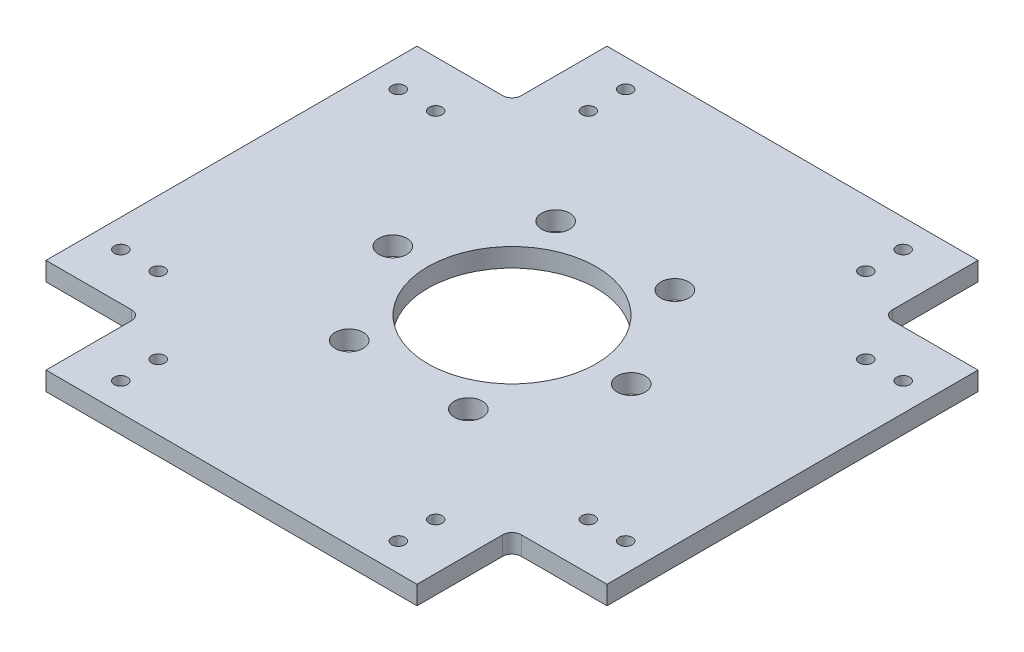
ISO-10303-21;
HEADER;
FILE_DESCRIPTION(('STEP AP214'),'2;1');
FILE_NAME('part.step','',(''),(''),'','','');
FILE_SCHEMA(('AUTOMOTIVE_DESIGN { 1 0 10303 214 1 1 1 1 }'));
ENDSEC;
DATA;
#1=APPLICATION_CONTEXT('core data for automotive mechanical design processes');
#2=APPLICATION_PROTOCOL_DEFINITION('international standard','automotive_design',2000,#1);
#3=PRODUCT_CONTEXT('',#1,'mechanical');
#4=PRODUCT('Part','Part','',(#3));
#5=PRODUCT_RELATED_PRODUCT_CATEGORY('part','',(#4));
#6=PRODUCT_DEFINITION_FORMATION('','',#4);
#7=PRODUCT_DEFINITION_CONTEXT('part definition',#1,'design');
#8=PRODUCT_DEFINITION('design','',#6,#7);
#9=PRODUCT_DEFINITION_SHAPE('','',#8);
#10=(LENGTH_UNIT() NAMED_UNIT(*) SI_UNIT(.MILLI.,.METRE.));
#11=(NAMED_UNIT(*) PLANE_ANGLE_UNIT() SI_UNIT($,.RADIAN.));
#12=(NAMED_UNIT(*) SI_UNIT($,.STERADIAN.) SOLID_ANGLE_UNIT());
#13=UNCERTAINTY_MEASURE_WITH_UNIT(LENGTH_MEASURE(1.E-05),#10,'distance_accuracy_value','');
#14=(GEOMETRIC_REPRESENTATION_CONTEXT(3) GLOBAL_UNCERTAINTY_ASSIGNED_CONTEXT((#13)) GLOBAL_UNIT_ASSIGNED_CONTEXT((#10,
#11,#12)) REPRESENTATION_CONTEXT('',''));
#15=CARTESIAN_POINT('',(0.,0.,0.));
#16=DIRECTION('',(0.,0.,1.));
#17=DIRECTION('',(1.,0.,0.));
#18=AXIS2_PLACEMENT_3D('',#15,#16,#17);
#19=CARTESIAN_POINT('',(0.,10.,0.));
#20=DIRECTION('',(0.,-1.,0.));
#21=DIRECTION('',(0.,0.,-1.));
#22=AXIS2_PLACEMENT_3D('',#19,#20,#21);
#23=PLANE('',#22);
#24=CARTESIAN_POINT('',(-63.75,10.,0.));
#25=DIRECTION('',(0.,-1.,0.));
#26=DIRECTION('',(0.,0.,-1.));
#27=AXIS2_PLACEMENT_3D('',#24,#25,#26);
#28=CIRCLE('',#27,7.49999999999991);
#29=CARTESIAN_POINT('',(-63.75,10.,-7.4999999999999));
#30=VERTEX_POINT('',#29);
#31=EDGE_CURVE('E925',#30,#30,#28,.T.);
#32=ORIENTED_EDGE('',*,*,#31,.T.);
#33=EDGE_LOOP('',(#32));
#34=FACE_BOUND('',#33,.T.);
#35=CARTESIAN_POINT('',(-31.8749999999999,10.,55.2091194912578));
#36=DIRECTION('',(0.,-1.,0.));
#37=DIRECTION('',(0.,0.,-1.));
#38=AXIS2_PLACEMENT_3D('',#35,#36,#37);
#39=CIRCLE('',#38,7.49999999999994);
#40=CARTESIAN_POINT('',(-31.8749999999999,10.,47.7091194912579));
#41=VERTEX_POINT('',#40);
#42=EDGE_CURVE('E1148',#41,#41,#39,.T.);
#43=ORIENTED_EDGE('',*,*,#42,.T.);
#44=EDGE_LOOP('',(#43));
#45=FACE_BOUND('',#44,.T.);
#46=CARTESIAN_POINT('',(31.8750000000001,10.,55.2091194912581));
#47=DIRECTION('',(0.,-1.,0.));
#48=DIRECTION('',(0.,0.,-1.));
#49=AXIS2_PLACEMENT_3D('',#46,#47,#48);
#50=CIRCLE('',#49,7.50000000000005);
#51=CARTESIAN_POINT('',(31.8750000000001,10.,47.709119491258));
#52=VERTEX_POINT('',#51);
#53=EDGE_CURVE('E1138',#52,#52,#50,.T.);
#54=ORIENTED_EDGE('',*,*,#53,.T.);
#55=EDGE_LOOP('',(#54));
#56=FACE_BOUND('',#55,.T.);
#57=CARTESIAN_POINT('',(63.7500000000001,10.,0.));
#58=DIRECTION('',(0.,-1.,0.));
#59=DIRECTION('',(0.,0.,-1.));
#60=AXIS2_PLACEMENT_3D('',#57,#58,#59);
#61=CIRCLE('',#60,7.5);
#62=CARTESIAN_POINT('',(63.7500000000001,10.,-7.50000000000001));
#63=VERTEX_POINT('',#62);
#64=EDGE_CURVE('E1128',#63,#63,#61,.T.);
#65=ORIENTED_EDGE('',*,*,#64,.T.);
#66=EDGE_LOOP('',(#65));
#67=FACE_BOUND('',#66,.T.);
#68=CARTESIAN_POINT('',(31.875,10.,-55.2091194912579));
#69=DIRECTION('',(0.,-1.,0.));
#70=DIRECTION('',(0.,0.,-1.));
#71=AXIS2_PLACEMENT_3D('',#68,#69,#70);
#72=CIRCLE('',#71,7.50000000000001);
#73=CARTESIAN_POINT('',(31.875,10.,-62.7091194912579));
#74=VERTEX_POINT('',#73);
#75=EDGE_CURVE('E946',#74,#74,#72,.T.);
#76=ORIENTED_EDGE('',*,*,#75,.T.);
#77=EDGE_LOOP('',(#76));
#78=FACE_BOUND('',#77,.T.);
#79=CARTESIAN_POINT('',(-31.875,10.,-55.2091194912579));
#80=DIRECTION('',(0.,-1.,0.));
#81=DIRECTION('',(0.,0.,-1.));
#82=AXIS2_PLACEMENT_3D('',#79,#80,#81);
#83=CIRCLE('',#82,7.49999999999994);
#84=CARTESIAN_POINT('',(-31.875,10.,-62.7091194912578));
#85=VERTEX_POINT('',#84);
#86=EDGE_CURVE('E937',#85,#85,#83,.T.);
#87=ORIENTED_EDGE('',*,*,#86,.T.);
#88=EDGE_LOOP('',(#87));
#89=FACE_BOUND('',#88,.T.);
#90=CARTESIAN_POINT('',(74.1999999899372,10.,-135.000000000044));
#91=DIRECTION('',(0.,1.,0.));
#92=DIRECTION('',(0.,0.,1.));
#93=AXIS2_PLACEMENT_3D('',#90,#91,#92);
#94=CIRCLE('',#93,3.49999999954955);
#95=CARTESIAN_POINT('',(74.1999999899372,10.,-131.500000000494));
#96=VERTEX_POINT('',#95);
#97=EDGE_CURVE('E574',#96,#96,#94,.T.);
#98=ORIENTED_EDGE('',*,*,#97,.F.);
#99=EDGE_LOOP('',(#98));
#100=FACE_BOUND('',#99,.T.);
#101=CARTESIAN_POINT('',(-74.1999999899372,10.,135.000000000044));
#102=DIRECTION('',(0.,1.,0.));
#103=DIRECTION('',(0.,0.,1.));
#104=AXIS2_PLACEMENT_3D('',#101,#102,#103);
#105=CIRCLE('',#104,3.49999999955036);
#106=CARTESIAN_POINT('',(-74.1999999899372,10.,138.499999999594));
#107=VERTEX_POINT('',#106);
#108=EDGE_CURVE('E985',#107,#107,#105,.T.);
#109=ORIENTED_EDGE('',*,*,#108,.F.);
#110=EDGE_LOOP('',(#109));
#111=FACE_BOUND('',#110,.T.);
#112=CARTESIAN_POINT('',(-115.000000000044,10.,-74.1999999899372));
#113=DIRECTION('',(0.,1.,0.));
#114=DIRECTION('',(0.,0.,1.));
#115=AXIS2_PLACEMENT_3D('',#112,#113,#114);
#116=CIRCLE('',#115,3.49999999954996);
#117=CARTESIAN_POINT('',(-115.000000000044,10.,-70.6999999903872));
#118=VERTEX_POINT('',#117);
#119=EDGE_CURVE('E609',#118,#118,#116,.T.);
#120=ORIENTED_EDGE('',*,*,#119,.F.);
#121=EDGE_LOOP('',(#120));
#122=FACE_BOUND('',#121,.T.);
#123=CARTESIAN_POINT('',(74.1999999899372,10.,-115.000000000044));
#124=DIRECTION('',(0.,1.,0.));
#125=DIRECTION('',(0.,0.,1.));
#126=AXIS2_PLACEMENT_3D('',#123,#124,#125);
#127=CIRCLE('',#126,3.49999999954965);
#128=CARTESIAN_POINT('',(74.1999999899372,10.,-111.500000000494));
#129=VERTEX_POINT('',#128);
#130=EDGE_CURVE('E601',#129,#129,#127,.T.);
#131=ORIENTED_EDGE('',*,*,#130,.F.);
#132=EDGE_LOOP('',(#131));
#133=FACE_BOUND('',#132,.T.);
#134=CARTESIAN_POINT('',(135.000000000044,10.,74.1999999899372));
#135=DIRECTION('',(0.,1.,0.));
#136=DIRECTION('',(0.,0.,1.));
#137=AXIS2_PLACEMENT_3D('',#134,#135,#136);
#138=CIRCLE('',#137,3.49999999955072);
#139=CARTESIAN_POINT('',(135.000000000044,10.,77.6999999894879));
#140=VERTEX_POINT('',#139);
#141=EDGE_CURVE('E941',#140,#140,#138,.T.);
#142=ORIENTED_EDGE('',*,*,#141,.F.);
#143=EDGE_LOOP('',(#142));
#144=FACE_BOUND('',#143,.T.);
#145=CARTESIAN_POINT('',(115.000000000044,10.,74.1999999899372));
#146=DIRECTION('',(0.,1.,0.));
#147=DIRECTION('',(0.,0.,1.));
#148=AXIS2_PLACEMENT_3D('',#145,#146,#147);
#149=CIRCLE('',#148,3.49999999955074);
#150=CARTESIAN_POINT('',(115.000000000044,10.,77.6999999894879));
#151=VERTEX_POINT('',#150);
#152=EDGE_CURVE('E958',#151,#151,#149,.T.);
#153=ORIENTED_EDGE('',*,*,#152,.F.);
#154=EDGE_LOOP('',(#153));
#155=FACE_BOUND('',#154,.T.);
#156=CARTESIAN_POINT('',(-74.1999999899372,10.,115.000000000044));
#157=DIRECTION('',(0.,1.,0.));
#158=DIRECTION('',(0.,0.,1.));
#159=AXIS2_PLACEMENT_3D('',#156,#157,#158);
#160=CIRCLE('',#159,3.4999999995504);
#161=CARTESIAN_POINT('',(-74.1999999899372,10.,118.499999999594));
#162=VERTEX_POINT('',#161);
#163=EDGE_CURVE('E986',#162,#162,#160,.T.);
#164=ORIENTED_EDGE('',*,*,#163,.F.);
#165=EDGE_LOOP('',(#164));
#166=FACE_BOUND('',#165,.T.);
#167=CARTESIAN_POINT('',(-135.000000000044,10.,-74.1999999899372));
#168=DIRECTION('',(0.,1.,0.));
#169=DIRECTION('',(0.,0.,1.));
#170=AXIS2_PLACEMENT_3D('',#167,#168,#169);
#171=CIRCLE('',#170,3.49999999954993);
#172=CARTESIAN_POINT('',(-135.000000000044,10.,-70.6999999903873));
#173=VERTEX_POINT('',#172);
#174=EDGE_CURVE('E411',#173,#173,#171,.T.);
#175=ORIENTED_EDGE('',*,*,#174,.F.);
#176=EDGE_LOOP('',(#175));
#177=FACE_BOUND('',#176,.T.);
#178=DIRECTION('',(1.,0.,0.));
#179=VECTOR('',#178,1.);
#180=CARTESIAN_POINT('',(-150.,10.,99.2000000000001));
#181=LINE('',#180,#179);
#182=CARTESIAN_POINT('',(-150.,10.,99.2000000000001));
#183=VERTEX_POINT('',#182);
#184=CARTESIAN_POINT('',(-104.2,10.,99.2000000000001));
#185=VERTEX_POINT('',#184);
#186=EDGE_CURVE('E457',#183,#185,#181,.T.);
#187=ORIENTED_EDGE('',*,*,#186,.T.);
#188=CARTESIAN_POINT('',(-104.2,10.,104.2));
#189=DIRECTION('',(0.,-1.,0.));
#190=DIRECTION('',(0.,0.,-1.));
#191=AXIS2_PLACEMENT_3D('',#188,#189,#190);
#192=CIRCLE('',#191,5.);
#193=CARTESIAN_POINT('',(-99.2,10.,104.2));
#194=VERTEX_POINT('',#193);
#195=EDGE_CURVE('E167',#185,#194,#192,.T.);
#196=ORIENTED_EDGE('',*,*,#195,.T.);
#197=DIRECTION('',(0.,0.,1.));
#198=VECTOR('',#197,1.);
#199=CARTESIAN_POINT('',(-99.2,10.,150.));
#200=LINE('',#199,#198);
#201=CARTESIAN_POINT('',(-99.2,10.,150.));
#202=VERTEX_POINT('',#201);
#203=EDGE_CURVE('E159',#194,#202,#200,.T.);
#204=ORIENTED_EDGE('',*,*,#203,.T.);
#205=DIRECTION('',(1.,0.,0.));
#206=VECTOR('',#205,1.);
#207=CARTESIAN_POINT('',(-99.2,10.,150.));
#208=LINE('',#207,#206);
#209=CARTESIAN_POINT('',(99.2000000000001,10.,150.));
#210=VERTEX_POINT('',#209);
#211=EDGE_CURVE('E164',#202,#210,#208,.T.);
#212=ORIENTED_EDGE('',*,*,#211,.T.);
#213=DIRECTION('',(0.,0.,-1.));
#214=VECTOR('',#213,1.);
#215=CARTESIAN_POINT('',(99.2000000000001,10.,150.));
#216=LINE('',#215,#214);
#217=CARTESIAN_POINT('',(99.2,10.,104.2));
#218=VERTEX_POINT('',#217);
#219=EDGE_CURVE('E183',#210,#218,#216,.T.);
#220=ORIENTED_EDGE('',*,*,#219,.T.);
#221=CARTESIAN_POINT('',(104.2,10.,104.2));
#222=DIRECTION('',(0.,-1.,0.));
#223=DIRECTION('',(0.,0.,-1.));
#224=AXIS2_PLACEMENT_3D('',#221,#222,#223);
#225=CIRCLE('',#224,5.);
#226=CARTESIAN_POINT('',(104.2,10.,99.2000000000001));
#227=VERTEX_POINT('',#226);
#228=EDGE_CURVE('E231',#218,#227,#225,.T.);
#229=ORIENTED_EDGE('',*,*,#228,.T.);
#230=DIRECTION('',(1.,0.,0.));
#231=VECTOR('',#230,1.);
#232=CARTESIAN_POINT('',(150.,10.,99.2000000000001));
#233=LINE('',#232,#231);
#234=CARTESIAN_POINT('',(150.,10.,99.2000000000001));
#235=VERTEX_POINT('',#234);
#236=EDGE_CURVE('E432',#227,#235,#233,.T.);
#237=ORIENTED_EDGE('',*,*,#236,.T.);
#238=DIRECTION('',(0.,0.,-1.));
#239=VECTOR('',#238,1.);
#240=CARTESIAN_POINT('',(150.,10.,99.2000000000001));
#241=LINE('',#240,#239);
#242=CARTESIAN_POINT('',(150.,10.,-99.1999999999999));
#243=VERTEX_POINT('',#242);
#244=EDGE_CURVE('E435',#235,#243,#241,.T.);
#245=ORIENTED_EDGE('',*,*,#244,.T.);
#246=DIRECTION('',(-1.,0.,0.));
#247=VECTOR('',#246,1.);
#248=CARTESIAN_POINT('',(150.,10.,-99.1999999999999));
#249=LINE('',#248,#247);
#250=CARTESIAN_POINT('',(104.2,10.,-99.2));
#251=VERTEX_POINT('',#250);
#252=EDGE_CURVE('E438',#243,#251,#249,.T.);
#253=ORIENTED_EDGE('',*,*,#252,.T.);
#254=CARTESIAN_POINT('',(104.2,10.,-104.2));
#255=DIRECTION('',(0.,-1.,0.));
#256=DIRECTION('',(0.,0.,-1.));
#257=AXIS2_PLACEMENT_3D('',#254,#255,#256);
#258=CIRCLE('',#257,5.);
#259=CARTESIAN_POINT('',(99.2,10.,-104.2));
#260=VERTEX_POINT('',#259);
#261=EDGE_CURVE('E237',#251,#260,#258,.T.);
#262=ORIENTED_EDGE('',*,*,#261,.T.);
#263=DIRECTION('',(0.,0.,-1.));
#264=VECTOR('',#263,1.);
#265=CARTESIAN_POINT('',(99.2,10.,-150.));
#266=LINE('',#265,#264);
#267=CARTESIAN_POINT('',(99.2,10.,-150.));
#268=VERTEX_POINT('',#267);
#269=EDGE_CURVE('E442',#260,#268,#266,.T.);
#270=ORIENTED_EDGE('',*,*,#269,.T.);
#271=DIRECTION('',(-1.,0.,0.));
#272=VECTOR('',#271,1.);
#273=CARTESIAN_POINT('',(-99.2000000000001,10.,-150.));
#274=LINE('',#273,#272);
#275=CARTESIAN_POINT('',(-99.2000000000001,10.,-150.));
#276=VERTEX_POINT('',#275);
#277=EDGE_CURVE('E445',#268,#276,#274,.T.);
#278=ORIENTED_EDGE('',*,*,#277,.T.);
#279=DIRECTION('',(0.,0.,1.));
#280=VECTOR('',#279,1.);
#281=CARTESIAN_POINT('',(-99.2000000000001,10.,-150.));
#282=LINE('',#281,#280);
#283=CARTESIAN_POINT('',(-99.2,10.,-104.2));
#284=VERTEX_POINT('',#283);
#285=EDGE_CURVE('E448',#276,#284,#282,.T.);
#286=ORIENTED_EDGE('',*,*,#285,.T.);
#287=CARTESIAN_POINT('',(-104.2,10.,-104.2));
#288=DIRECTION('',(0.,-1.,0.));
#289=DIRECTION('',(0.,0.,-1.));
#290=AXIS2_PLACEMENT_3D('',#287,#288,#289);
#291=CIRCLE('',#290,5.);
#292=CARTESIAN_POINT('',(-104.2,10.,-99.2));
#293=VERTEX_POINT('',#292);
#294=EDGE_CURVE('E242',#284,#293,#291,.T.);
#295=ORIENTED_EDGE('',*,*,#294,.T.);
#296=DIRECTION('',(-1.,0.,0.));
#297=VECTOR('',#296,1.);
#298=CARTESIAN_POINT('',(-150.,10.,-99.2));
#299=LINE('',#298,#297);
#300=CARTESIAN_POINT('',(-150.,10.,-99.2));
#301=VERTEX_POINT('',#300);
#302=EDGE_CURVE('E451',#293,#301,#299,.T.);
#303=ORIENTED_EDGE('',*,*,#302,.T.);
#304=DIRECTION('',(0.,0.,1.));
#305=VECTOR('',#304,1.);
#306=CARTESIAN_POINT('',(-150.,10.,99.2000000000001));
#307=LINE('',#306,#305);
#308=EDGE_CURVE('E454',#301,#183,#307,.T.);
#309=ORIENTED_EDGE('',*,*,#308,.T.);
#310=EDGE_LOOP('',(#187,#196,#204,#212,#220,#229,#237,#245,#253,#262,#270,#278,#286,#295,#303,#309));
#311=FACE_BOUND('',#310,.T.);
#312=CARTESIAN_POINT('',(0.,10.,0.));
#313=DIRECTION('',(0.,1.,0.));
#314=DIRECTION('',(0.,0.,1.));
#315=AXIS2_PLACEMENT_3D('',#312,#313,#314);
#316=CIRCLE('',#315,45.);
#317=CARTESIAN_POINT('',(0.,10.,45.));
#318=VERTEX_POINT('',#317);
#319=EDGE_CURVE('E423',#318,#318,#316,.T.);
#320=ORIENTED_EDGE('',*,*,#319,.F.);
#321=EDGE_LOOP('',(#320));
#322=FACE_BOUND('',#321,.T.);
#323=CARTESIAN_POINT('',(74.1999999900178,10.,114.999999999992));
#324=DIRECTION('',(0.,1.,0.));
#325=DIRECTION('',(0.,0.,1.));
#326=AXIS2_PLACEMENT_3D('',#323,#324,#325);
#327=CIRCLE('',#326,3.50000000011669);
#328=CARTESIAN_POINT('',(74.1999999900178,10.,118.500000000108));
#329=VERTEX_POINT('',#328);
#330=EDGE_CURVE('E949',#329,#329,#327,.F.);
#331=ORIENTED_EDGE('',*,*,#330,.T.);
#332=EDGE_LOOP('',(#331));
#333=FACE_BOUND('',#332,.T.);
#334=CARTESIAN_POINT('',(-114.999999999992,10.,74.1999999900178));
#335=DIRECTION('',(0.,1.,0.));
#336=DIRECTION('',(0.,0.,1.));
#337=AXIS2_PLACEMENT_3D('',#334,#335,#336);
#338=CIRCLE('',#337,3.50000000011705);
#339=CARTESIAN_POINT('',(-114.999999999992,10.,77.6999999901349));
#340=VERTEX_POINT('',#339);
#341=EDGE_CURVE('E972',#340,#340,#338,.F.);
#342=ORIENTED_EDGE('',*,*,#341,.T.);
#343=EDGE_LOOP('',(#342));
#344=FACE_BOUND('',#343,.T.);
#345=CARTESIAN_POINT('',(-134.999999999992,10.,74.1999999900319));
#346=DIRECTION('',(0.,1.,0.));
#347=DIRECTION('',(0.,0.,1.));
#348=AXIS2_PLACEMENT_3D('',#345,#346,#347);
#349=CIRCLE('',#348,3.50000000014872);
#350=CARTESIAN_POINT('',(-134.999999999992,10.,77.6999999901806));
#351=VERTEX_POINT('',#350);
#352=EDGE_CURVE('E971',#351,#351,#349,.F.);
#353=ORIENTED_EDGE('',*,*,#352,.T.);
#354=EDGE_LOOP('',(#353));
#355=FACE_BOUND('',#354,.T.);
#356=CARTESIAN_POINT('',(74.1999999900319,10.,134.999999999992));
#357=DIRECTION('',(0.,1.,0.));
#358=DIRECTION('',(0.,0.,1.));
#359=AXIS2_PLACEMENT_3D('',#356,#357,#358);
#360=CIRCLE('',#359,3.50000000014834);
#361=CARTESIAN_POINT('',(74.1999999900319,10.,138.50000000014));
#362=VERTEX_POINT('',#361);
#363=EDGE_CURVE('E950',#362,#362,#360,.F.);
#364=ORIENTED_EDGE('',*,*,#363,.T.);
#365=EDGE_LOOP('',(#364));
#366=FACE_BOUND('',#365,.T.);
#367=CARTESIAN_POINT('',(-74.1999999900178,10.,-114.999999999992));
#368=DIRECTION('',(0.,1.,0.));
#369=DIRECTION('',(0.,0.,1.));
#370=AXIS2_PLACEMENT_3D('',#367,#368,#369);
#371=CIRCLE('',#370,3.50000000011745);
#372=CARTESIAN_POINT('',(-74.1999999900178,10.,-111.499999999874));
#373=VERTEX_POINT('',#372);
#374=EDGE_CURVE('E593',#373,#373,#371,.F.);
#375=ORIENTED_EDGE('',*,*,#374,.T.);
#376=EDGE_LOOP('',(#375));
#377=FACE_BOUND('',#376,.T.);
#378=CARTESIAN_POINT('',(-74.1999999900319,10.,-134.999999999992));
#379=DIRECTION('',(0.,1.,0.));
#380=DIRECTION('',(0.,0.,1.));
#381=AXIS2_PLACEMENT_3D('',#378,#379,#380);
#382=CIRCLE('',#381,3.50000000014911);
#383=CARTESIAN_POINT('',(-74.1999999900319,10.,-131.499999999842));
#384=VERTEX_POINT('',#383);
#385=EDGE_CURVE('E592',#384,#384,#382,.F.);
#386=ORIENTED_EDGE('',*,*,#385,.T.);
#387=EDGE_LOOP('',(#386));
#388=FACE_BOUND('',#387,.T.);
#389=CARTESIAN_POINT('',(134.999999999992,10.,-74.1999999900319));
#390=DIRECTION('',(0.,1.,0.));
#391=DIRECTION('',(0.,0.,1.));
#392=AXIS2_PLACEMENT_3D('',#389,#390,#391);
#393=CIRCLE('',#392,3.50000000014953);
#394=CARTESIAN_POINT('',(134.999999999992,10.,-70.6999999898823));
#395=VERTEX_POINT('',#394);
#396=EDGE_CURVE('E1000',#395,#395,#393,.F.);
#397=ORIENTED_EDGE('',*,*,#396,.T.);
#398=EDGE_LOOP('',(#397));
#399=FACE_BOUND('',#398,.T.);
#400=CARTESIAN_POINT('',(114.999999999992,10.,-74.1999999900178));
#401=DIRECTION('',(0.,1.,0.));
#402=DIRECTION('',(0.,0.,1.));
#403=AXIS2_PLACEMENT_3D('',#400,#401,#402);
#404=CIRCLE('',#403,3.50000000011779);
#405=CARTESIAN_POINT('',(114.999999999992,10.,-70.6999999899));
#406=VERTEX_POINT('',#405);
#407=EDGE_CURVE('E575',#406,#406,#404,.F.);
#408=ORIENTED_EDGE('',*,*,#407,.T.);
#409=EDGE_LOOP('',(#408));
#410=FACE_BOUND('',#409,.T.);
#411=ADVANCED_FACE('F43',(#34,#45,#56,#67,#78,#89,#100,#111,#122,#133,#144,#155,#166,#177,#311,
#322,#333,#344,#355,#366,#377,#388,#399,#410),#23,.F.);
#412=CARTESIAN_POINT('',(0.,0.,0.));
#413=DIRECTION('',(0.,-1.,0.));
#414=DIRECTION('',(0.,0.,-1.));
#415=AXIS2_PLACEMENT_3D('',#412,#413,#414);
#416=PLANE('',#415);
#417=CARTESIAN_POINT('',(-63.75,0.,0.));
#418=DIRECTION('',(0.,-1.,0.));
#419=DIRECTION('',(0.,0.,-1.));
#420=AXIS2_PLACEMENT_3D('',#417,#418,#419);
#421=CIRCLE('',#420,7.49999999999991);
#422=CARTESIAN_POINT('',(-63.75,0.,-7.4999999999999));
#423=VERTEX_POINT('',#422);
#424=EDGE_CURVE('E928',#423,#423,#421,.T.);
#425=ORIENTED_EDGE('',*,*,#424,.F.);
#426=EDGE_LOOP('',(#425));
#427=FACE_BOUND('',#426,.T.);
#428=CARTESIAN_POINT('',(-31.8749999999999,0.,55.2091194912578));
#429=DIRECTION('',(0.,-1.,0.));
#430=DIRECTION('',(0.,0.,-1.));
#431=AXIS2_PLACEMENT_3D('',#428,#429,#430);
#432=CIRCLE('',#431,7.49999999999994);
#433=CARTESIAN_POINT('',(-31.8749999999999,0.,47.7091194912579));
#434=VERTEX_POINT('',#433);
#435=EDGE_CURVE('E933',#434,#434,#432,.T.);
#436=ORIENTED_EDGE('',*,*,#435,.F.);
#437=EDGE_LOOP('',(#436));
#438=FACE_BOUND('',#437,.T.);
#439=CARTESIAN_POINT('',(31.8750000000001,0.,55.2091194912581));
#440=DIRECTION('',(0.,-1.,0.));
#441=DIRECTION('',(0.,0.,-1.));
#442=AXIS2_PLACEMENT_3D('',#439,#440,#441);
#443=CIRCLE('',#442,7.50000000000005);
#444=CARTESIAN_POINT('',(31.8750000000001,0.,47.709119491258));
#445=VERTEX_POINT('',#444);
#446=EDGE_CURVE('E1143',#445,#445,#443,.T.);
#447=ORIENTED_EDGE('',*,*,#446,.F.);
#448=EDGE_LOOP('',(#447));
#449=FACE_BOUND('',#448,.T.);
#450=CARTESIAN_POINT('',(63.7500000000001,0.,0.));
#451=DIRECTION('',(0.,-1.,0.));
#452=DIRECTION('',(0.,0.,-1.));
#453=AXIS2_PLACEMENT_3D('',#450,#451,#452);
#454=CIRCLE('',#453,7.5);
#455=CARTESIAN_POINT('',(63.7500000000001,0.,-7.50000000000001));
#456=VERTEX_POINT('',#455);
#457=EDGE_CURVE('E1133',#456,#456,#454,.T.);
#458=ORIENTED_EDGE('',*,*,#457,.F.);
#459=EDGE_LOOP('',(#458));
#460=FACE_BOUND('',#459,.T.);
#461=CARTESIAN_POINT('',(31.875,0.,-55.2091194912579));
#462=DIRECTION('',(0.,-1.,0.));
#463=DIRECTION('',(0.,0.,-1.));
#464=AXIS2_PLACEMENT_3D('',#461,#462,#463);
#465=CIRCLE('',#464,7.50000000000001);
#466=CARTESIAN_POINT('',(31.875,0.,-62.7091194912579));
#467=VERTEX_POINT('',#466);
#468=EDGE_CURVE('E1123',#467,#467,#465,.T.);
#469=ORIENTED_EDGE('',*,*,#468,.F.);
#470=EDGE_LOOP('',(#469));
#471=FACE_BOUND('',#470,.T.);
#472=CARTESIAN_POINT('',(-31.875,0.,-55.2091194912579));
#473=DIRECTION('',(0.,-1.,0.));
#474=DIRECTION('',(0.,0.,-1.));
#475=AXIS2_PLACEMENT_3D('',#472,#473,#474);
#476=CIRCLE('',#475,7.49999999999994);
#477=CARTESIAN_POINT('',(-31.875,0.,-62.7091194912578));
#478=VERTEX_POINT('',#477);
#479=EDGE_CURVE('E942',#478,#478,#476,.T.);
#480=ORIENTED_EDGE('',*,*,#479,.F.);
#481=EDGE_LOOP('',(#480));
#482=FACE_BOUND('',#481,.T.);
#483=CARTESIAN_POINT('',(74.1999999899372,0.,-135.000000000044));
#484=DIRECTION('',(0.,1.,0.));
#485=DIRECTION('',(0.,0.,1.));
#486=AXIS2_PLACEMENT_3D('',#483,#484,#485);
#487=CIRCLE('',#486,3.49999999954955);
#488=CARTESIAN_POINT('',(74.1999999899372,0.,-131.500000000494));
#489=VERTEX_POINT('',#488);
#490=EDGE_CURVE('E581',#489,#489,#487,.T.);
#491=ORIENTED_EDGE('',*,*,#490,.T.);
#492=EDGE_LOOP('',(#491));
#493=FACE_BOUND('',#492,.T.);
#494=CARTESIAN_POINT('',(134.999999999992,0.,-74.1999999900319));
#495=DIRECTION('',(0.,1.,0.));
#496=DIRECTION('',(0.,0.,1.));
#497=AXIS2_PLACEMENT_3D('',#494,#495,#496);
#498=CIRCLE('',#497,3.50000000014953);
#499=CARTESIAN_POINT('',(134.999999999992,0.,-70.6999999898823));
#500=VERTEX_POINT('',#499);
#501=EDGE_CURVE('E584',#500,#500,#498,.F.);
#502=ORIENTED_EDGE('',*,*,#501,.F.);
#503=EDGE_LOOP('',(#502));
#504=FACE_BOUND('',#503,.T.);
#505=CARTESIAN_POINT('',(-74.1999999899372,0.,135.000000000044));
#506=DIRECTION('',(0.,1.,0.));
#507=DIRECTION('',(0.,0.,1.));
#508=AXIS2_PLACEMENT_3D('',#505,#506,#507);
#509=CIRCLE('',#508,3.49999999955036);
#510=CARTESIAN_POINT('',(-74.1999999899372,0.,138.499999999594));
#511=VERTEX_POINT('',#510);
#512=EDGE_CURVE('E1004',#511,#511,#509,.T.);
#513=ORIENTED_EDGE('',*,*,#512,.T.);
#514=EDGE_LOOP('',(#513));
#515=FACE_BOUND('',#514,.T.);
#516=CARTESIAN_POINT('',(-115.000000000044,0.,-74.1999999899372));
#517=DIRECTION('',(0.,1.,0.));
#518=DIRECTION('',(0.,0.,1.));
#519=AXIS2_PLACEMENT_3D('',#516,#517,#518);
#520=CIRCLE('',#519,3.49999999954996);
#521=CARTESIAN_POINT('',(-115.000000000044,0.,-70.6999999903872));
#522=VERTEX_POINT('',#521);
#523=EDGE_CURVE('E605',#522,#522,#520,.T.);
#524=ORIENTED_EDGE('',*,*,#523,.T.);
#525=EDGE_LOOP('',(#524));
#526=FACE_BOUND('',#525,.T.);
#527=CARTESIAN_POINT('',(-74.1999999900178,0.,-114.999999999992));
#528=DIRECTION('',(0.,1.,0.));
#529=DIRECTION('',(0.,0.,1.));
#530=AXIS2_PLACEMENT_3D('',#527,#528,#529);
#531=CIRCLE('',#530,3.50000000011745);
#532=CARTESIAN_POINT('',(-74.1999999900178,0.,-111.499999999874));
#533=VERTEX_POINT('',#532);
#534=EDGE_CURVE('E588',#533,#533,#531,.F.);
#535=ORIENTED_EDGE('',*,*,#534,.F.);
#536=EDGE_LOOP('',(#535));
#537=FACE_BOUND('',#536,.T.);
#538=CARTESIAN_POINT('',(74.1999999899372,0.,-115.000000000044));
#539=DIRECTION('',(0.,1.,0.));
#540=DIRECTION('',(0.,0.,1.));
#541=AXIS2_PLACEMENT_3D('',#538,#539,#540);
#542=CIRCLE('',#541,3.49999999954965);
#543=CARTESIAN_POINT('',(74.1999999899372,0.,-111.500000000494));
#544=VERTEX_POINT('',#543);
#545=EDGE_CURVE('E597',#544,#544,#542,.T.);
#546=ORIENTED_EDGE('',*,*,#545,.T.);
#547=EDGE_LOOP('',(#546));
#548=FACE_BOUND('',#547,.T.);
#549=CARTESIAN_POINT('',(135.000000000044,0.,74.1999999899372));
#550=DIRECTION('',(0.,1.,0.));
#551=DIRECTION('',(0.,0.,1.));
#552=AXIS2_PLACEMENT_3D('',#549,#550,#551);
#553=CIRCLE('',#552,3.49999999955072);
#554=CARTESIAN_POINT('',(135.000000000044,0.,77.6999999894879));
#555=VERTEX_POINT('',#554);
#556=EDGE_CURVE('E962',#555,#555,#553,.T.);
#557=ORIENTED_EDGE('',*,*,#556,.T.);
#558=EDGE_LOOP('',(#557));
#559=FACE_BOUND('',#558,.T.);
#560=CARTESIAN_POINT('',(115.000000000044,0.,74.1999999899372));
#561=DIRECTION('',(0.,1.,0.));
#562=DIRECTION('',(0.,0.,1.));
#563=AXIS2_PLACEMENT_3D('',#560,#561,#562);
#564=CIRCLE('',#563,3.49999999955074);
#565=CARTESIAN_POINT('',(115.000000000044,0.,77.6999999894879));
#566=VERTEX_POINT('',#565);
#567=EDGE_CURVE('E954',#566,#566,#564,.T.);
#568=ORIENTED_EDGE('',*,*,#567,.T.);
#569=EDGE_LOOP('',(#568));
#570=FACE_BOUND('',#569,.T.);
#571=CARTESIAN_POINT('',(-134.999999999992,0.,74.1999999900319));
#572=DIRECTION('',(0.,1.,0.));
#573=DIRECTION('',(0.,0.,1.));
#574=AXIS2_PLACEMENT_3D('',#571,#572,#573);
#575=CIRCLE('',#574,3.50000000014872);
#576=CARTESIAN_POINT('',(-134.999999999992,0.,77.6999999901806));
#577=VERTEX_POINT('',#576);
#578=EDGE_CURVE('E990',#577,#577,#575,.F.);
#579=ORIENTED_EDGE('',*,*,#578,.F.);
#580=EDGE_LOOP('',(#579));
#581=FACE_BOUND('',#580,.T.);
#582=CARTESIAN_POINT('',(74.1999999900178,0.,114.999999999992));
#583=DIRECTION('',(0.,1.,0.));
#584=DIRECTION('',(0.,0.,1.));
#585=AXIS2_PLACEMENT_3D('',#582,#583,#584);
#586=CIRCLE('',#585,3.50000000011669);
#587=CARTESIAN_POINT('',(74.1999999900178,0.,118.500000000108));
#588=VERTEX_POINT('',#587);
#589=EDGE_CURVE('E976',#588,#588,#586,.F.);
#590=ORIENTED_EDGE('',*,*,#589,.F.);
#591=EDGE_LOOP('',(#590));
#592=FACE_BOUND('',#591,.T.);
#593=CARTESIAN_POINT('',(-135.000000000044,0.,-74.1999999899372));
#594=DIRECTION('',(0.,1.,0.));
#595=DIRECTION('',(0.,0.,1.));
#596=AXIS2_PLACEMENT_3D('',#593,#594,#595);
#597=CIRCLE('',#596,3.49999999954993);
#598=CARTESIAN_POINT('',(-135.000000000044,0.,-70.6999999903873));
#599=VERTEX_POINT('',#598);
#600=EDGE_CURVE('E402',#599,#599,#597,.T.);
#601=ORIENTED_EDGE('',*,*,#600,.T.);
#602=EDGE_LOOP('',(#601));
#603=FACE_BOUND('',#602,.T.);
#604=CARTESIAN_POINT('',(-40.1279204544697,0.,80.0000000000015));
#605=DIRECTION('',(0.,-1.,0.));
#606=DIRECTION('',(0.,0.,-1.));
#607=AXIS2_PLACEMENT_3D('',#604,#605,#606);
#608=CIRCLE('',#607,7.35000000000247);
#609=CARTESIAN_POINT('',(-40.1279204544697,0.,72.6499999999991));
#610=VERTEX_POINT('',#609);
#611=EDGE_CURVE('E261',#610,#610,#608,.F.);
#612=ORIENTED_EDGE('',*,*,#611,.T.);
#613=EDGE_LOOP('',(#612));
#614=FACE_BOUND('',#613,.T.);
#615=CARTESIAN_POINT('',(40.1279204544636,0.,80.0000000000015));
#616=DIRECTION('',(0.,-1.,0.));
#617=DIRECTION('',(0.,0.,-1.));
#618=AXIS2_PLACEMENT_3D('',#615,#616,#617);
#619=CIRCLE('',#618,7.35000000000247);
#620=CARTESIAN_POINT('',(40.1279204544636,0.,72.6499999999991));
#621=VERTEX_POINT('',#620);
#622=EDGE_CURVE('E257',#621,#621,#619,.F.);
#623=ORIENTED_EDGE('',*,*,#622,.T.);
#624=EDGE_LOOP('',(#623));
#625=FACE_BOUND('',#624,.T.);
#626=CARTESIAN_POINT('',(-40.1279204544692,0.,-79.9999999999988));
#627=DIRECTION('',(0.,-1.,0.));
#628=DIRECTION('',(0.,0.,-1.));
#629=AXIS2_PLACEMENT_3D('',#626,#627,#628);
#630=CIRCLE('',#629,7.35000000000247);
#631=CARTESIAN_POINT('',(-40.1279204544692,0.,-87.3500000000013));
#632=VERTEX_POINT('',#631);
#633=EDGE_CURVE('E253',#632,#632,#630,.F.);
#634=ORIENTED_EDGE('',*,*,#633,.T.);
#635=EDGE_LOOP('',(#634));
#636=FACE_BOUND('',#635,.T.);
#637=CARTESIAN_POINT('',(40.1279204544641,0.,-79.9999999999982));
#638=DIRECTION('',(0.,-1.,0.));
#639=DIRECTION('',(0.,0.,-1.));
#640=AXIS2_PLACEMENT_3D('',#637,#638,#639);
#641=CIRCLE('',#640,7.35000000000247);
#642=CARTESIAN_POINT('',(40.1279204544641,0.,-87.3500000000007));
#643=VERTEX_POINT('',#642);
#644=EDGE_CURVE('E249',#643,#643,#641,.F.);
#645=ORIENTED_EDGE('',*,*,#644,.T.);
#646=EDGE_LOOP('',(#645));
#647=FACE_BOUND('',#646,.T.);
#648=DIRECTION('',(0.,0.,1.));
#649=VECTOR('',#648,1.);
#650=CARTESIAN_POINT('',(-99.2,0.,150.));
#651=LINE('',#650,#649);
#652=CARTESIAN_POINT('',(-99.2,0.,104.2));
#653=VERTEX_POINT('',#652);
#654=CARTESIAN_POINT('',(-99.2,0.,150.));
#655=VERTEX_POINT('',#654);
#656=EDGE_CURVE('E187',#653,#655,#651,.T.);
#657=ORIENTED_EDGE('',*,*,#656,.F.);
#658=CARTESIAN_POINT('',(-104.2,0.,104.2));
#659=DIRECTION('',(0.,-1.,0.));
#660=DIRECTION('',(0.,0.,-1.));
#661=AXIS2_PLACEMENT_3D('',#658,#659,#660);
#662=CIRCLE('',#661,5.);
#663=CARTESIAN_POINT('',(-104.2,0.,99.2000000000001));
#664=VERTEX_POINT('',#663);
#665=EDGE_CURVE('E223',#653,#664,#662,.F.);
#666=ORIENTED_EDGE('',*,*,#665,.T.);
#667=DIRECTION('',(1.,0.,0.));
#668=VECTOR('',#667,1.);
#669=CARTESIAN_POINT('',(-150.,0.,99.2000000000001));
#670=LINE('',#669,#668);
#671=CARTESIAN_POINT('',(-150.,0.,99.2000000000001));
#672=VERTEX_POINT('',#671);
#673=EDGE_CURVE('E173',#672,#664,#670,.T.);
#674=ORIENTED_EDGE('',*,*,#673,.F.);
#675=DIRECTION('',(0.,0.,1.));
#676=VECTOR('',#675,1.);
#677=CARTESIAN_POINT('',(-150.,0.,99.2000000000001));
#678=LINE('',#677,#676);
#679=CARTESIAN_POINT('',(-150.,0.,-99.2));
#680=VERTEX_POINT('',#679);
#681=EDGE_CURVE('E492',#680,#672,#678,.T.);
#682=ORIENTED_EDGE('',*,*,#681,.F.);
#683=DIRECTION('',(-1.,0.,0.));
#684=VECTOR('',#683,1.);
#685=CARTESIAN_POINT('',(-150.,0.,-99.2));
#686=LINE('',#685,#684);
#687=CARTESIAN_POINT('',(-104.2,0.,-99.2));
#688=VERTEX_POINT('',#687);
#689=EDGE_CURVE('E489',#688,#680,#686,.T.);
#690=ORIENTED_EDGE('',*,*,#689,.F.);
#691=CARTESIAN_POINT('',(-104.2,0.,-104.2));
#692=DIRECTION('',(0.,-1.,0.));
#693=DIRECTION('',(0.,0.,-1.));
#694=AXIS2_PLACEMENT_3D('',#691,#692,#693);
#695=CIRCLE('',#694,5.);
#696=CARTESIAN_POINT('',(-99.2,0.,-104.2));
#697=VERTEX_POINT('',#696);
#698=EDGE_CURVE('E68',#688,#697,#695,.F.);
#699=ORIENTED_EDGE('',*,*,#698,.T.);
#700=DIRECTION('',(0.,0.,1.));
#701=VECTOR('',#700,1.);
#702=CARTESIAN_POINT('',(-99.2000000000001,0.,-150.));
#703=LINE('',#702,#701);
#704=CARTESIAN_POINT('',(-99.2000000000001,0.,-150.));
#705=VERTEX_POINT('',#704);
#706=EDGE_CURVE('E486',#705,#697,#703,.T.);
#707=ORIENTED_EDGE('',*,*,#706,.F.);
#708=DIRECTION('',(-1.,0.,0.));
#709=VECTOR('',#708,1.);
#710=CARTESIAN_POINT('',(-99.2000000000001,0.,-150.));
#711=LINE('',#710,#709);
#712=CARTESIAN_POINT('',(99.2,0.,-150.));
#713=VERTEX_POINT('',#712);
#714=EDGE_CURVE('E483',#713,#705,#711,.T.);
#715=ORIENTED_EDGE('',*,*,#714,.F.);
#716=DIRECTION('',(0.,0.,-1.));
#717=VECTOR('',#716,1.);
#718=CARTESIAN_POINT('',(99.2,0.,-150.));
#719=LINE('',#718,#717);
#720=CARTESIAN_POINT('',(99.2,0.,-104.2));
#721=VERTEX_POINT('',#720);
#722=EDGE_CURVE('E480',#721,#713,#719,.T.);
#723=ORIENTED_EDGE('',*,*,#722,.F.);
#724=CARTESIAN_POINT('',(104.2,0.,-104.2));
#725=DIRECTION('',(0.,-1.,0.));
#726=DIRECTION('',(0.,0.,-1.));
#727=AXIS2_PLACEMENT_3D('',#724,#725,#726);
#728=CIRCLE('',#727,5.);
#729=CARTESIAN_POINT('',(104.2,0.,-99.2));
#730=VERTEX_POINT('',#729);
#731=EDGE_CURVE('E234',#721,#730,#728,.F.);
#732=ORIENTED_EDGE('',*,*,#731,.T.);
#733=DIRECTION('',(-1.,0.,0.));
#734=VECTOR('',#733,1.);
#735=CARTESIAN_POINT('',(150.,0.,-99.1999999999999));
#736=LINE('',#735,#734);
#737=CARTESIAN_POINT('',(150.,0.,-99.1999999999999));
#738=VERTEX_POINT('',#737);
#739=EDGE_CURVE('E476',#738,#730,#736,.T.);
#740=ORIENTED_EDGE('',*,*,#739,.F.);
#741=DIRECTION('',(0.,0.,-1.));
#742=VECTOR('',#741,1.);
#743=CARTESIAN_POINT('',(150.,0.,99.2000000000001));
#744=LINE('',#743,#742);
#745=CARTESIAN_POINT('',(150.,0.,99.2000000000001));
#746=VERTEX_POINT('',#745);
#747=EDGE_CURVE('E473',#746,#738,#744,.T.);
#748=ORIENTED_EDGE('',*,*,#747,.F.);
#749=DIRECTION('',(1.,0.,0.));
#750=VECTOR('',#749,1.);
#751=CARTESIAN_POINT('',(150.,0.,99.2000000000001));
#752=LINE('',#751,#750);
#753=CARTESIAN_POINT('',(104.2,0.,99.2000000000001));
#754=VERTEX_POINT('',#753);
#755=EDGE_CURVE('E470',#754,#746,#752,.T.);
#756=ORIENTED_EDGE('',*,*,#755,.F.);
#757=CARTESIAN_POINT('',(104.2,0.,104.2));
#758=DIRECTION('',(0.,-1.,0.));
#759=DIRECTION('',(0.,0.,-1.));
#760=AXIS2_PLACEMENT_3D('',#757,#758,#759);
#761=CIRCLE('',#760,5.);
#762=CARTESIAN_POINT('',(99.2,0.,104.2));
#763=VERTEX_POINT('',#762);
#764=EDGE_CURVE('E228',#754,#763,#761,.F.);
#765=ORIENTED_EDGE('',*,*,#764,.T.);
#766=DIRECTION('',(0.,0.,-1.));
#767=VECTOR('',#766,1.);
#768=CARTESIAN_POINT('',(99.2000000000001,0.,150.));
#769=LINE('',#768,#767);
#770=CARTESIAN_POINT('',(99.2000000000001,0.,150.));
#771=VERTEX_POINT('',#770);
#772=EDGE_CURVE('E466',#771,#763,#769,.T.);
#773=ORIENTED_EDGE('',*,*,#772,.F.);
#774=DIRECTION('',(1.,0.,0.));
#775=VECTOR('',#774,1.);
#776=CARTESIAN_POINT('',(-99.2,0.,150.));
#777=LINE('',#776,#775);
#778=EDGE_CURVE('E463',#655,#771,#777,.T.);
#779=ORIENTED_EDGE('',*,*,#778,.F.);
#780=EDGE_LOOP('',(#657,#666,#674,#682,#690,#699,#707,#715,#723,#732,#740,#748,#756,#765,#773,#779));
#781=FACE_BOUND('',#780,.T.);
#782=CARTESIAN_POINT('',(0.,0.,0.));
#783=DIRECTION('',(0.,1.,0.));
#784=DIRECTION('',(0.,0.,1.));
#785=AXIS2_PLACEMENT_3D('',#782,#783,#784);
#786=CIRCLE('',#785,45.);
#787=CARTESIAN_POINT('',(0.,0.,45.));
#788=VERTEX_POINT('',#787);
#789=EDGE_CURVE('E422',#788,#788,#786,.T.);
#790=ORIENTED_EDGE('',*,*,#789,.T.);
#791=EDGE_LOOP('',(#790));
#792=FACE_BOUND('',#791,.T.);
#793=CARTESIAN_POINT('',(-114.999999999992,0.,74.1999999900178));
#794=DIRECTION('',(0.,1.,0.));
#795=DIRECTION('',(0.,0.,1.));
#796=AXIS2_PLACEMENT_3D('',#793,#794,#795);
#797=CIRCLE('',#796,3.50000000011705);
#798=CARTESIAN_POINT('',(-114.999999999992,0.,77.6999999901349));
#799=VERTEX_POINT('',#798);
#800=EDGE_CURVE('E556',#799,#799,#797,.F.);
#801=ORIENTED_EDGE('',*,*,#800,.F.);
#802=EDGE_LOOP('',(#801));
#803=FACE_BOUND('',#802,.T.);
#804=CARTESIAN_POINT('',(-74.1999999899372,0.,115.000000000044));
#805=DIRECTION('',(0.,1.,0.));
#806=DIRECTION('',(0.,0.,1.));
#807=AXIS2_PLACEMENT_3D('',#804,#805,#806);
#808=CIRCLE('',#807,3.4999999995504);
#809=CARTESIAN_POINT('',(-74.1999999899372,0.,118.499999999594));
#810=VERTEX_POINT('',#809);
#811=EDGE_CURVE('E560',#810,#810,#808,.T.);
#812=ORIENTED_EDGE('',*,*,#811,.T.);
#813=EDGE_LOOP('',(#812));
#814=FACE_BOUND('',#813,.T.);
#815=CARTESIAN_POINT('',(74.1999999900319,0.,134.999999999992));
#816=DIRECTION('',(0.,1.,0.));
#817=DIRECTION('',(0.,0.,1.));
#818=AXIS2_PLACEMENT_3D('',#815,#816,#817);
#819=CIRCLE('',#818,3.50000000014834);
#820=CARTESIAN_POINT('',(74.1999999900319,0.,138.50000000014));
#821=VERTEX_POINT('',#820);
#822=EDGE_CURVE('E564',#821,#821,#819,.F.);
#823=ORIENTED_EDGE('',*,*,#822,.F.);
#824=EDGE_LOOP('',(#823));
#825=FACE_BOUND('',#824,.T.);
#826=CARTESIAN_POINT('',(-74.1999999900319,0.,-134.999999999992));
#827=DIRECTION('',(0.,1.,0.));
#828=DIRECTION('',(0.,0.,1.));
#829=AXIS2_PLACEMENT_3D('',#826,#827,#828);
#830=CIRCLE('',#829,3.50000000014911);
#831=CARTESIAN_POINT('',(-74.1999999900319,0.,-131.499999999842));
#832=VERTEX_POINT('',#831);
#833=EDGE_CURVE('E568',#832,#832,#830,.F.);
#834=ORIENTED_EDGE('',*,*,#833,.F.);
#835=EDGE_LOOP('',(#834));
#836=FACE_BOUND('',#835,.T.);
#837=CARTESIAN_POINT('',(114.999999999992,0.,-74.1999999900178));
#838=DIRECTION('',(0.,1.,0.));
#839=DIRECTION('',(0.,0.,1.));
#840=AXIS2_PLACEMENT_3D('',#837,#838,#839);
#841=CIRCLE('',#840,3.50000000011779);
#842=CARTESIAN_POINT('',(114.999999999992,0.,-70.6999999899));
#843=VERTEX_POINT('',#842);
#844=EDGE_CURVE('E571',#843,#843,#841,.F.);
#845=ORIENTED_EDGE('',*,*,#844,.F.);
#846=EDGE_LOOP('',(#845));
#847=FACE_BOUND('',#846,.T.);
#848=ADVANCED_FACE('F292',(#427,#438,#449,#460,#471,#482,#493,#504,#515,#526,#537,#548,#559,
#570,#581,#592,#603,#614,#625,#636,#647,#781,#792,#803,#814,#825,#836,#847),#416,.T.);
#849=CARTESIAN_POINT('',(-99.2,10.,150.));
#850=DIRECTION('',(1.,0.,0.));
#851=DIRECTION('',(0.,0.,-1.));
#852=AXIS2_PLACEMENT_3D('',#849,#850,#851);
#853=PLANE('',#852);
#854=ORIENTED_EDGE('',*,*,#203,.F.);
#855=DIRECTION('',(0.,-1.,0.));
#856=VECTOR('',#855,1.);
#857=CARTESIAN_POINT('',(-99.2,0.,104.2));
#858=LINE('',#857,#856);
#859=EDGE_CURVE('E190',#194,#653,#858,.T.);
#860=ORIENTED_EDGE('',*,*,#859,.T.);
#861=ORIENTED_EDGE('',*,*,#656,.T.);
#862=DIRECTION('',(0.,-1.,0.));
#863=VECTOR('',#862,1.);
#864=CARTESIAN_POINT('',(-99.2,10.,150.));
#865=LINE('',#864,#863);
#866=EDGE_CURVE('E178',#202,#655,#865,.T.);
#867=ORIENTED_EDGE('',*,*,#866,.F.);
#868=EDGE_LOOP('',(#854,#860,#861,#867));
#869=FACE_BOUND('',#868,.T.);
#870=ADVANCED_FACE('F185',(#869),#853,.F.);
#871=CARTESIAN_POINT('',(-99.2,10.,150.));
#872=DIRECTION('',(0.,0.,-1.));
#873=DIRECTION('',(-1.,0.,0.));
#874=AXIS2_PLACEMENT_3D('',#871,#872,#873);
#875=PLANE('',#874);
#876=ORIENTED_EDGE('',*,*,#778,.T.);
#877=DIRECTION('',(0.,-1.,0.));
#878=VECTOR('',#877,1.);
#879=CARTESIAN_POINT('',(99.2000000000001,10.,150.));
#880=LINE('',#879,#878);
#881=EDGE_CURVE('E180',#210,#771,#880,.T.);
#882=ORIENTED_EDGE('',*,*,#881,.F.);
#883=ORIENTED_EDGE('',*,*,#211,.F.);
#884=ORIENTED_EDGE('',*,*,#866,.T.);
#885=EDGE_LOOP('',(#876,#882,#883,#884));
#886=FACE_BOUND('',#885,.T.);
#887=ADVANCED_FACE('F177',(#886),#875,.F.);
#888=CARTESIAN_POINT('',(99.2000000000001,10.,150.));
#889=DIRECTION('',(-1.,0.,0.));
#890=DIRECTION('',(0.,0.,1.));
#891=AXIS2_PLACEMENT_3D('',#888,#889,#890);
#892=PLANE('',#891);
#893=ORIENTED_EDGE('',*,*,#772,.T.);
#894=DIRECTION('',(0.,-1.,0.));
#895=VECTOR('',#894,1.);
#896=CARTESIAN_POINT('',(99.2,10.,104.2));
#897=LINE('',#896,#895);
#898=EDGE_CURVE('E207',#763,#218,#897,.F.);
#899=ORIENTED_EDGE('',*,*,#898,.T.);
#900=ORIENTED_EDGE('',*,*,#219,.F.);
#901=ORIENTED_EDGE('',*,*,#881,.T.);
#902=EDGE_LOOP('',(#893,#899,#900,#901));
#903=FACE_BOUND('',#902,.T.);
#904=ADVANCED_FACE('F341',(#903),#892,.F.);
#905=CARTESIAN_POINT('',(150.,10.,99.2000000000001));
#906=DIRECTION('',(0.,0.,-1.));
#907=DIRECTION('',(-1.,0.,0.));
#908=AXIS2_PLACEMENT_3D('',#905,#906,#907);
#909=PLANE('',#908);
#910=ORIENTED_EDGE('',*,*,#236,.F.);
#911=DIRECTION('',(0.,-1.,0.));
#912=VECTOR('',#911,1.);
#913=CARTESIAN_POINT('',(104.2,0.,99.2000000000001));
#914=LINE('',#913,#912);
#915=EDGE_CURVE('E203',#227,#754,#914,.T.);
#916=ORIENTED_EDGE('',*,*,#915,.T.);
#917=ORIENTED_EDGE('',*,*,#755,.T.);
#918=DIRECTION('',(0.,-1.,0.));
#919=VECTOR('',#918,1.);
#920=CARTESIAN_POINT('',(150.,10.,99.2000000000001));
#921=LINE('',#920,#919);
#922=EDGE_CURVE('E197',#235,#746,#921,.T.);
#923=ORIENTED_EDGE('',*,*,#922,.F.);
#924=EDGE_LOOP('',(#910,#916,#917,#923));
#925=FACE_BOUND('',#924,.T.);
#926=ADVANCED_FACE('F337',(#925),#909,.F.);
#927=CARTESIAN_POINT('',(150.,10.,99.2000000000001));
#928=DIRECTION('',(-1.,0.,0.));
#929=DIRECTION('',(0.,0.,1.));
#930=AXIS2_PLACEMENT_3D('',#927,#928,#929);
#931=PLANE('',#930);
#932=ORIENTED_EDGE('',*,*,#747,.T.);
#933=DIRECTION('',(0.,-1.,0.));
#934=VECTOR('',#933,1.);
#935=CARTESIAN_POINT('',(150.,10.,-99.1999999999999));
#936=LINE('',#935,#934);
#937=EDGE_CURVE('E513',#243,#738,#936,.T.);
#938=ORIENTED_EDGE('',*,*,#937,.F.);
#939=ORIENTED_EDGE('',*,*,#244,.F.);
#940=ORIENTED_EDGE('',*,*,#922,.T.);
#941=EDGE_LOOP('',(#932,#938,#939,#940));
#942=FACE_BOUND('',#941,.T.);
#943=ADVANCED_FACE('F333',(#942),#931,.F.);
#944=CARTESIAN_POINT('',(150.,10.,-99.1999999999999));
#945=DIRECTION('',(0.,0.,1.));
#946=DIRECTION('',(1.,0.,0.));
#947=AXIS2_PLACEMENT_3D('',#944,#945,#946);
#948=PLANE('',#947);
#949=ORIENTED_EDGE('',*,*,#739,.T.);
#950=DIRECTION('',(0.,-1.,0.));
#951=VECTOR('',#950,1.);
#952=CARTESIAN_POINT('',(104.2,10.,-99.2));
#953=LINE('',#952,#951);
#954=EDGE_CURVE('E214',#730,#251,#953,.F.);
#955=ORIENTED_EDGE('',*,*,#954,.T.);
#956=ORIENTED_EDGE('',*,*,#252,.F.);
#957=ORIENTED_EDGE('',*,*,#937,.T.);
#958=EDGE_LOOP('',(#949,#955,#956,#957));
#959=FACE_BOUND('',#958,.T.);
#960=ADVANCED_FACE('F329',(#959),#948,.F.);
#961=CARTESIAN_POINT('',(99.2,10.,-150.));
#962=DIRECTION('',(-1.,0.,0.));
#963=DIRECTION('',(0.,0.,1.));
#964=AXIS2_PLACEMENT_3D('',#961,#962,#963);
#965=PLANE('',#964);
#966=ORIENTED_EDGE('',*,*,#269,.F.);
#967=DIRECTION('',(0.,-1.,0.));
#968=VECTOR('',#967,1.);
#969=CARTESIAN_POINT('',(99.2,0.,-104.2));
#970=LINE('',#969,#968);
#971=EDGE_CURVE('E210',#260,#721,#970,.T.);
#972=ORIENTED_EDGE('',*,*,#971,.T.);
#973=ORIENTED_EDGE('',*,*,#722,.T.);
#974=DIRECTION('',(0.,-1.,0.));
#975=VECTOR('',#974,1.);
#976=CARTESIAN_POINT('',(99.2,10.,-150.));
#977=LINE('',#976,#975);
#978=EDGE_CURVE('E509',#268,#713,#977,.T.);
#979=ORIENTED_EDGE('',*,*,#978,.F.);
#980=EDGE_LOOP('',(#966,#972,#973,#979));
#981=FACE_BOUND('',#980,.T.);
#982=ADVANCED_FACE('F325',(#981),#965,.F.);
#983=CARTESIAN_POINT('',(-99.2000000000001,10.,-150.));
#984=DIRECTION('',(0.,0.,1.));
#985=DIRECTION('',(1.,0.,0.));
#986=AXIS2_PLACEMENT_3D('',#983,#984,#985);
#987=PLANE('',#986);
#988=ORIENTED_EDGE('',*,*,#714,.T.);
#989=DIRECTION('',(0.,-1.,0.));
#990=VECTOR('',#989,1.);
#991=CARTESIAN_POINT('',(-99.2000000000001,10.,-150.));
#992=LINE('',#991,#990);
#993=EDGE_CURVE('E505',#276,#705,#992,.T.);
#994=ORIENTED_EDGE('',*,*,#993,.F.);
#995=ORIENTED_EDGE('',*,*,#277,.F.);
#996=ORIENTED_EDGE('',*,*,#978,.T.);
#997=EDGE_LOOP('',(#988,#994,#995,#996));
#998=FACE_BOUND('',#997,.T.);
#999=ADVANCED_FACE('F322',(#998),#987,.F.);
#1000=CARTESIAN_POINT('',(-99.2000000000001,10.,-150.));
#1001=DIRECTION('',(1.,0.,0.));
#1002=DIRECTION('',(0.,0.,-1.));
#1003=AXIS2_PLACEMENT_3D('',#1000,#1001,#1002);
#1004=PLANE('',#1003);
#1005=ORIENTED_EDGE('',*,*,#706,.T.);
#1006=DIRECTION('',(0.,-1.,0.));
#1007=VECTOR('',#1006,1.);
#1008=CARTESIAN_POINT('',(-99.2,10.,-104.2));
#1009=LINE('',#1008,#1007);
#1010=EDGE_CURVE('E60',#697,#284,#1009,.F.);
#1011=ORIENTED_EDGE('',*,*,#1010,.T.);
#1012=ORIENTED_EDGE('',*,*,#285,.F.);
#1013=ORIENTED_EDGE('',*,*,#993,.T.);
#1014=EDGE_LOOP('',(#1005,#1011,#1012,#1013));
#1015=FACE_BOUND('',#1014,.T.);
#1016=ADVANCED_FACE('F318',(#1015),#1004,.F.);
#1017=CARTESIAN_POINT('',(-150.,10.,-99.2));
#1018=DIRECTION('',(0.,0.,1.));
#1019=DIRECTION('',(1.,0.,0.));
#1020=AXIS2_PLACEMENT_3D('',#1017,#1018,#1019);
#1021=PLANE('',#1020);
#1022=ORIENTED_EDGE('',*,*,#302,.F.);
#1023=DIRECTION('',(0.,-1.,0.));
#1024=VECTOR('',#1023,1.);
#1025=CARTESIAN_POINT('',(-104.2,0.,-99.2));
#1026=LINE('',#1025,#1024);
#1027=EDGE_CURVE('E217',#293,#688,#1026,.T.);
#1028=ORIENTED_EDGE('',*,*,#1027,.T.);
#1029=ORIENTED_EDGE('',*,*,#689,.T.);
#1030=DIRECTION('',(0.,-1.,0.));
#1031=VECTOR('',#1030,1.);
#1032=CARTESIAN_POINT('',(-150.,10.,-99.2));
#1033=LINE('',#1032,#1031);
#1034=EDGE_CURVE('E501',#301,#680,#1033,.T.);
#1035=ORIENTED_EDGE('',*,*,#1034,.F.);
#1036=EDGE_LOOP('',(#1022,#1028,#1029,#1035));
#1037=FACE_BOUND('',#1036,.T.);
#1038=ADVANCED_FACE('F314',(#1037),#1021,.F.);
#1039=CARTESIAN_POINT('',(-150.,10.,99.2000000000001));
#1040=DIRECTION('',(1.,0.,0.));
#1041=DIRECTION('',(0.,0.,-1.));
#1042=AXIS2_PLACEMENT_3D('',#1039,#1040,#1041);
#1043=PLANE('',#1042);
#1044=ORIENTED_EDGE('',*,*,#681,.T.);
#1045=DIRECTION('',(0.,-1.,0.));
#1046=VECTOR('',#1045,1.);
#1047=CARTESIAN_POINT('',(-150.,10.,99.2000000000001));
#1048=LINE('',#1047,#1046);
#1049=EDGE_CURVE('E460',#183,#672,#1048,.T.);
#1050=ORIENTED_EDGE('',*,*,#1049,.F.);
#1051=ORIENTED_EDGE('',*,*,#308,.F.);
#1052=ORIENTED_EDGE('',*,*,#1034,.T.);
#1053=EDGE_LOOP('',(#1044,#1050,#1051,#1052));
#1054=FACE_BOUND('',#1053,.T.);
#1055=ADVANCED_FACE('F310',(#1054),#1043,.F.);
#1056=CARTESIAN_POINT('',(-150.,10.,99.2000000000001));
#1057=DIRECTION('',(0.,0.,-1.));
#1058=DIRECTION('',(-1.,0.,0.));
#1059=AXIS2_PLACEMENT_3D('',#1056,#1057,#1058);
#1060=PLANE('',#1059);
#1061=ORIENTED_EDGE('',*,*,#673,.T.);
#1062=DIRECTION('',(0.,-1.,0.));
#1063=VECTOR('',#1062,1.);
#1064=CARTESIAN_POINT('',(-104.2,10.,99.2000000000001));
#1065=LINE('',#1064,#1063);
#1066=EDGE_CURVE('E195',#664,#185,#1065,.F.);
#1067=ORIENTED_EDGE('',*,*,#1066,.T.);
#1068=ORIENTED_EDGE('',*,*,#186,.F.);
#1069=ORIENTED_EDGE('',*,*,#1049,.T.);
#1070=EDGE_LOOP('',(#1061,#1067,#1068,#1069));
#1071=FACE_BOUND('',#1070,.T.);
#1072=ADVANCED_FACE('F307',(#1071),#1060,.F.);
#1073=CARTESIAN_POINT('',(0.,10.,0.));
#1074=DIRECTION('',(0.,-1.,0.));
#1075=DIRECTION('',(0.,0.,-1.));
#1076=AXIS2_PLACEMENT_3D('',#1073,#1074,#1075);
#1077=CYLINDRICAL_SURFACE('',#1076,45.);
#1078=ORIENTED_EDGE('',*,*,#319,.T.);
#1079=EDGE_LOOP('',(#1078));
#1080=FACE_BOUND('',#1079,.T.);
#1081=ORIENTED_EDGE('',*,*,#789,.F.);
#1082=EDGE_LOOP('',(#1081));
#1083=FACE_BOUND('',#1082,.T.);
#1084=ADVANCED_FACE('F304',(#1080,#1083),#1077,.F.);
#1085=CARTESIAN_POINT('',(-104.2,10.,104.2));
#1086=DIRECTION('',(0.,1.,0.));
#1087=DIRECTION('',(0.,0.,1.));
#1088=AXIS2_PLACEMENT_3D('',#1085,#1086,#1087);
#1089=CYLINDRICAL_SURFACE('',#1088,5.);
#1090=ORIENTED_EDGE('',*,*,#195,.F.);
#1091=ORIENTED_EDGE('',*,*,#1066,.F.);
#1092=ORIENTED_EDGE('',*,*,#665,.F.);
#1093=ORIENTED_EDGE('',*,*,#859,.F.);
#1094=EDGE_LOOP('',(#1090,#1091,#1092,#1093));
#1095=FACE_BOUND('',#1094,.T.);
#1096=ADVANCED_FACE('F350',(#1095),#1089,.F.);
#1097=CARTESIAN_POINT('',(104.2,10.,104.2));
#1098=DIRECTION('',(0.,1.,0.));
#1099=DIRECTION('',(0.,0.,1.));
#1100=AXIS2_PLACEMENT_3D('',#1097,#1098,#1099);
#1101=CYLINDRICAL_SURFACE('',#1100,5.);
#1102=ORIENTED_EDGE('',*,*,#228,.F.);
#1103=ORIENTED_EDGE('',*,*,#898,.F.);
#1104=ORIENTED_EDGE('',*,*,#764,.F.);
#1105=ORIENTED_EDGE('',*,*,#915,.F.);
#1106=EDGE_LOOP('',(#1102,#1103,#1104,#1105));
#1107=FACE_BOUND('',#1106,.T.);
#1108=ADVANCED_FACE('F353',(#1107),#1101,.F.);
#1109=CARTESIAN_POINT('',(104.2,10.,-104.2));
#1110=DIRECTION('',(0.,1.,0.));
#1111=DIRECTION('',(0.,0.,1.));
#1112=AXIS2_PLACEMENT_3D('',#1109,#1110,#1111);
#1113=CYLINDRICAL_SURFACE('',#1112,5.);
#1114=ORIENTED_EDGE('',*,*,#261,.F.);
#1115=ORIENTED_EDGE('',*,*,#954,.F.);
#1116=ORIENTED_EDGE('',*,*,#731,.F.);
#1117=ORIENTED_EDGE('',*,*,#971,.F.);
#1118=EDGE_LOOP('',(#1114,#1115,#1116,#1117));
#1119=FACE_BOUND('',#1118,.T.);
#1120=ADVANCED_FACE('F357',(#1119),#1113,.F.);
#1121=CARTESIAN_POINT('',(-104.2,10.,-104.2));
#1122=DIRECTION('',(0.,1.,0.));
#1123=DIRECTION('',(0.,0.,1.));
#1124=AXIS2_PLACEMENT_3D('',#1121,#1122,#1123);
#1125=CYLINDRICAL_SURFACE('',#1124,5.);
#1126=ORIENTED_EDGE('',*,*,#294,.F.);
#1127=ORIENTED_EDGE('',*,*,#1010,.F.);
#1128=ORIENTED_EDGE('',*,*,#698,.F.);
#1129=ORIENTED_EDGE('',*,*,#1027,.F.);
#1130=EDGE_LOOP('',(#1126,#1127,#1128,#1129));
#1131=FACE_BOUND('',#1130,.T.);
#1132=ADVANCED_FACE('F361',(#1131),#1125,.F.);
#1133=CARTESIAN_POINT('',(40.1279204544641,5.,-79.9999999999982));
#1134=DIRECTION('',(0.,-1.,0.));
#1135=DIRECTION('',(0.,0.,-1.));
#1136=AXIS2_PLACEMENT_3D('',#1133,#1134,#1135);
#1137=CYLINDRICAL_SURFACE('',#1136,6.35000000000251);
#1138=CARTESIAN_POINT('',(40.1279204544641,0.999999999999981,-79.9999999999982));
#1139=DIRECTION('',(0.,-1.,0.));
#1140=DIRECTION('',(0.,0.,-1.));
#1141=AXIS2_PLACEMENT_3D('',#1138,#1139,#1140);
#1142=CIRCLE('',#1141,6.35000000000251);
#1143=CARTESIAN_POINT('',(40.1279204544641,0.999999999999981,-86.3500000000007));
#1144=VERTEX_POINT('',#1143);
#1145=EDGE_CURVE('E11',#1144,#1144,#1142,.T.);
#1146=ORIENTED_EDGE('',*,*,#1145,.T.);
#1147=EDGE_LOOP('',(#1146));
#1148=FACE_BOUND('',#1147,.T.);
#1149=CARTESIAN_POINT('',(40.1279204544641,5.,-79.9999999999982));
#1150=DIRECTION('',(0.,-1.,0.));
#1151=DIRECTION('',(0.,0.,-1.));
#1152=AXIS2_PLACEMENT_3D('',#1149,#1150,#1151);
#1153=CIRCLE('',#1152,6.35000000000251);
#1154=CARTESIAN_POINT('',(40.1279204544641,5.,-86.3500000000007));
#1155=VERTEX_POINT('',#1154);
#1156=EDGE_CURVE('E417',#1155,#1155,#1153,.T.);
#1157=ORIENTED_EDGE('',*,*,#1156,.F.);
#1158=EDGE_LOOP('',(#1157));
#1159=FACE_BOUND('',#1158,.T.);
#1160=ADVANCED_FACE('F365',(#1148,#1159),#1137,.F.);
#1161=CARTESIAN_POINT('',(40.1279204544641,5.,-79.9999999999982));
#1162=DIRECTION('',(0.,-1.,0.));
#1163=DIRECTION('',(0.,0.,-1.));
#1164=AXIS2_PLACEMENT_3D('',#1161,#1162,#1163);
#1165=PLANE('',#1164);
#1166=ORIENTED_EDGE('',*,*,#1156,.T.);
#1167=EDGE_LOOP('',(#1166));
#1168=FACE_BOUND('',#1167,.T.);
#1169=ADVANCED_FACE('F394',(#1168),#1165,.T.);
#1170=CARTESIAN_POINT('',(-40.1279204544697,5.,80.0000000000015));
#1171=DIRECTION('',(0.,-1.,0.));
#1172=DIRECTION('',(0.,0.,-1.));
#1173=AXIS2_PLACEMENT_3D('',#1170,#1171,#1172);
#1174=CYLINDRICAL_SURFACE('',#1173,6.35000000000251);
#1175=CARTESIAN_POINT('',(-40.1279204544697,0.999999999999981,80.0000000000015));
#1176=DIRECTION('',(0.,-1.,0.));
#1177=DIRECTION('',(0.,0.,-1.));
#1178=AXIS2_PLACEMENT_3D('',#1175,#1176,#1177);
#1179=CIRCLE('',#1178,6.35000000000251);
#1180=CARTESIAN_POINT('',(-40.1279204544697,0.999999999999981,73.649999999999));
#1181=VERTEX_POINT('',#1180);
#1182=EDGE_CURVE('E245',#1181,#1181,#1179,.T.);
#1183=ORIENTED_EDGE('',*,*,#1182,.T.);
#1184=EDGE_LOOP('',(#1183));
#1185=FACE_BOUND('',#1184,.T.);
#1186=CARTESIAN_POINT('',(-40.1279204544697,5.,80.0000000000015));
#1187=DIRECTION('',(0.,-1.,0.));
#1188=DIRECTION('',(0.,0.,-1.));
#1189=AXIS2_PLACEMENT_3D('',#1186,#1187,#1188);
#1190=CIRCLE('',#1189,6.35000000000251);
#1191=CARTESIAN_POINT('',(-40.1279204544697,5.,73.649999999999));
#1192=VERTEX_POINT('',#1191);
#1193=EDGE_CURVE('E398',#1192,#1192,#1190,.T.);
#1194=ORIENTED_EDGE('',*,*,#1193,.F.);
#1195=EDGE_LOOP('',(#1194));
#1196=FACE_BOUND('',#1195,.T.);
#1197=ADVANCED_FACE('F390',(#1185,#1196),#1174,.F.);
#1198=CARTESIAN_POINT('',(-40.1279204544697,5.,80.0000000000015));
#1199=DIRECTION('',(0.,-1.,0.));
#1200=DIRECTION('',(0.,0.,-1.));
#1201=AXIS2_PLACEMENT_3D('',#1198,#1199,#1200);
#1202=PLANE('',#1201);
#1203=ORIENTED_EDGE('',*,*,#1193,.T.);
#1204=EDGE_LOOP('',(#1203));
#1205=FACE_BOUND('',#1204,.T.);
#1206=ADVANCED_FACE('F393',(#1205),#1202,.T.);
#1207=CARTESIAN_POINT('',(40.1279204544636,5.,80.0000000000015));
#1208=DIRECTION('',(0.,-1.,0.));
#1209=DIRECTION('',(0.,0.,-1.));
#1210=AXIS2_PLACEMENT_3D('',#1207,#1208,#1209);
#1211=CYLINDRICAL_SURFACE('',#1210,6.35000000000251);
#1212=CARTESIAN_POINT('',(40.1279204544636,0.999999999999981,80.0000000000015));
#1213=DIRECTION('',(0.,-1.,0.));
#1214=DIRECTION('',(0.,0.,-1.));
#1215=AXIS2_PLACEMENT_3D('',#1212,#1213,#1214);
#1216=CIRCLE('',#1215,6.35000000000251);
#1217=CARTESIAN_POINT('',(40.1279204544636,0.999999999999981,73.649999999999));
#1218=VERTEX_POINT('',#1217);
#1219=EDGE_CURVE('E265',#1218,#1218,#1216,.T.);
#1220=ORIENTED_EDGE('',*,*,#1219,.T.);
#1221=EDGE_LOOP('',(#1220));
#1222=FACE_BOUND('',#1221,.T.);
#1223=CARTESIAN_POINT('',(40.1279204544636,5.,80.0000000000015));
#1224=DIRECTION('',(0.,-1.,0.));
#1225=DIRECTION('',(0.,0.,-1.));
#1226=AXIS2_PLACEMENT_3D('',#1223,#1224,#1225);
#1227=CIRCLE('',#1226,6.35000000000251);
#1228=CARTESIAN_POINT('',(40.1279204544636,5.,73.649999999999));
#1229=VERTEX_POINT('',#1228);
#1230=EDGE_CURVE('E401',#1229,#1229,#1227,.T.);
#1231=ORIENTED_EDGE('',*,*,#1230,.F.);
#1232=EDGE_LOOP('',(#1231));
#1233=FACE_BOUND('',#1232,.T.);
#1234=ADVANCED_FACE('F646',(#1222,#1233),#1211,.F.);
#1235=CARTESIAN_POINT('',(40.1279204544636,5.,80.0000000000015));
#1236=DIRECTION('',(0.,-1.,0.));
#1237=DIRECTION('',(0.,0.,-1.));
#1238=AXIS2_PLACEMENT_3D('',#1235,#1236,#1237);
#1239=PLANE('',#1238);
#1240=ORIENTED_EDGE('',*,*,#1230,.T.);
#1241=EDGE_LOOP('',(#1240));
#1242=FACE_BOUND('',#1241,.T.);
#1243=ADVANCED_FACE('F647',(#1242),#1239,.T.);
#1244=CARTESIAN_POINT('',(-40.1279204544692,5.,-79.9999999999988));
#1245=DIRECTION('',(0.,-1.,0.));
#1246=DIRECTION('',(0.,0.,-1.));
#1247=AXIS2_PLACEMENT_3D('',#1244,#1245,#1246);
#1248=CYLINDRICAL_SURFACE('',#1247,6.35000000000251);
#1249=CARTESIAN_POINT('',(-40.1279204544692,0.999999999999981,-79.9999999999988));
#1250=DIRECTION('',(0.,-1.,0.));
#1251=DIRECTION('',(0.,0.,-1.));
#1252=AXIS2_PLACEMENT_3D('',#1249,#1250,#1251);
#1253=CIRCLE('',#1252,6.35000000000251);
#1254=CARTESIAN_POINT('',(-40.1279204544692,0.999999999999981,-86.3500000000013));
#1255=VERTEX_POINT('',#1254);
#1256=EDGE_CURVE('E53',#1255,#1255,#1253,.T.);
#1257=ORIENTED_EDGE('',*,*,#1256,.T.);
#1258=EDGE_LOOP('',(#1257));
#1259=FACE_BOUND('',#1258,.T.);
#1260=CARTESIAN_POINT('',(-40.1279204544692,5.,-79.9999999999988));
#1261=DIRECTION('',(0.,-1.,0.));
#1262=DIRECTION('',(0.,0.,-1.));
#1263=AXIS2_PLACEMENT_3D('',#1260,#1261,#1262);
#1264=CIRCLE('',#1263,6.35000000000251);
#1265=CARTESIAN_POINT('',(-40.1279204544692,5.,-86.3500000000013));
#1266=VERTEX_POINT('',#1265);
#1267=EDGE_CURVE('E408',#1266,#1266,#1264,.T.);
#1268=ORIENTED_EDGE('',*,*,#1267,.F.);
#1269=EDGE_LOOP('',(#1268));
#1270=FACE_BOUND('',#1269,.T.);
#1271=ADVANCED_FACE('F273',(#1259,#1270),#1248,.F.);
#1272=CARTESIAN_POINT('',(-40.1279204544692,5.,-79.9999999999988));
#1273=DIRECTION('',(0.,-1.,0.));
#1274=DIRECTION('',(0.,0.,-1.));
#1275=AXIS2_PLACEMENT_3D('',#1272,#1273,#1274);
#1276=PLANE('',#1275);
#1277=ORIENTED_EDGE('',*,*,#1267,.T.);
#1278=EDGE_LOOP('',(#1277));
#1279=FACE_BOUND('',#1278,.T.);
#1280=ADVANCED_FACE('F372',(#1279),#1276,.T.);
#1281=CARTESIAN_POINT('',(-40.1279204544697,0.999999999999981,80.0000000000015));
#1282=DIRECTION('',(0.,-1.,0.));
#1283=DIRECTION('',(0.,0.,-1.));
#1284=AXIS2_PLACEMENT_3D('',#1281,#1282,#1283);
#1285=CONICAL_SURFACE('',#1284,6.35000000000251,0.785398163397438);
#1286=ORIENTED_EDGE('',*,*,#611,.F.);
#1287=EDGE_LOOP('',(#1286));
#1288=FACE_BOUND('',#1287,.T.);
#1289=ORIENTED_EDGE('',*,*,#1182,.F.);
#1290=EDGE_LOOP('',(#1289));
#1291=FACE_BOUND('',#1290,.T.);
#1292=ADVANCED_FACE('F286',(#1288,#1291),#1285,.F.);
#1293=CARTESIAN_POINT('',(40.1279204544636,0.999999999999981,80.0000000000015));
#1294=DIRECTION('',(0.,-1.,0.));
#1295=DIRECTION('',(0.,0.,-1.));
#1296=AXIS2_PLACEMENT_3D('',#1293,#1294,#1295);
#1297=CONICAL_SURFACE('',#1296,6.35000000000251,0.785398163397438);
#1298=ORIENTED_EDGE('',*,*,#622,.F.);
#1299=EDGE_LOOP('',(#1298));
#1300=FACE_BOUND('',#1299,.T.);
#1301=ORIENTED_EDGE('',*,*,#1219,.F.);
#1302=EDGE_LOOP('',(#1301));
#1303=FACE_BOUND('',#1302,.T.);
#1304=ADVANCED_FACE('F278',(#1300,#1303),#1297,.F.);
#1305=CARTESIAN_POINT('',(-40.1279204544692,0.999999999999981,-79.9999999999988));
#1306=DIRECTION('',(0.,-1.,0.));
#1307=DIRECTION('',(0.,0.,-1.));
#1308=AXIS2_PLACEMENT_3D('',#1305,#1306,#1307);
#1309=CONICAL_SURFACE('',#1308,6.35000000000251,0.785398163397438);
#1310=ORIENTED_EDGE('',*,*,#633,.F.);
#1311=EDGE_LOOP('',(#1310));
#1312=FACE_BOUND('',#1311,.T.);
#1313=ORIENTED_EDGE('',*,*,#1256,.F.);
#1314=EDGE_LOOP('',(#1313));
#1315=FACE_BOUND('',#1314,.T.);
#1316=ADVANCED_FACE('F276',(#1312,#1315),#1309,.F.);
#1317=CARTESIAN_POINT('',(40.1279204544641,0.999999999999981,-79.9999999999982));
#1318=DIRECTION('',(0.,-1.,0.));
#1319=DIRECTION('',(0.,0.,-1.));
#1320=AXIS2_PLACEMENT_3D('',#1317,#1318,#1319);
#1321=CONICAL_SURFACE('',#1320,6.35000000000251,0.785398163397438);
#1322=ORIENTED_EDGE('',*,*,#644,.F.);
#1323=EDGE_LOOP('',(#1322));
#1324=FACE_BOUND('',#1323,.T.);
#1325=ORIENTED_EDGE('',*,*,#1145,.F.);
#1326=EDGE_LOOP('',(#1325));
#1327=FACE_BOUND('',#1326,.T.);
#1328=ADVANCED_FACE('F46',(#1324,#1327),#1321,.F.);
#1329=CARTESIAN_POINT('',(-135.000000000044,0.,-74.1999999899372));
#1330=DIRECTION('',(0.,1.,0.));
#1331=DIRECTION('',(0.,0.,1.));
#1332=AXIS2_PLACEMENT_3D('',#1329,#1330,#1331);
#1333=CYLINDRICAL_SURFACE('',#1332,3.49999999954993);
#1334=ORIENTED_EDGE('',*,*,#600,.F.);
#1335=EDGE_LOOP('',(#1334));
#1336=FACE_BOUND('',#1335,.T.);
#1337=ORIENTED_EDGE('',*,*,#174,.T.);
#1338=EDGE_LOOP('',(#1337));
#1339=FACE_BOUND('',#1338,.T.);
#1340=ADVANCED_FACE('F284',(#1336,#1339),#1333,.F.);
#1341=CARTESIAN_POINT('',(74.1999999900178,0.,114.999999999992));
#1342=DIRECTION('',(0.,1.,0.));
#1343=DIRECTION('',(0.,0.,1.));
#1344=AXIS2_PLACEMENT_3D('',#1341,#1342,#1343);
#1345=CYLINDRICAL_SURFACE('',#1344,3.50000000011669);
#1346=ORIENTED_EDGE('',*,*,#589,.T.);
#1347=EDGE_LOOP('',(#1346));
#1348=FACE_BOUND('',#1347,.T.);
#1349=ORIENTED_EDGE('',*,*,#330,.F.);
#1350=EDGE_LOOP('',(#1349));
#1351=FACE_BOUND('',#1350,.T.);
#1352=ADVANCED_FACE('F641',(#1348,#1351),#1345,.F.);
#1353=CARTESIAN_POINT('',(-114.999999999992,0.,74.1999999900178));
#1354=DIRECTION('',(0.,1.,0.));
#1355=DIRECTION('',(0.,0.,1.));
#1356=AXIS2_PLACEMENT_3D('',#1353,#1354,#1355);
#1357=CYLINDRICAL_SURFACE('',#1356,3.50000000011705);
#1358=ORIENTED_EDGE('',*,*,#800,.T.);
#1359=EDGE_LOOP('',(#1358));
#1360=FACE_BOUND('',#1359,.T.);
#1361=ORIENTED_EDGE('',*,*,#341,.F.);
#1362=EDGE_LOOP('',(#1361));
#1363=FACE_BOUND('',#1362,.T.);
#1364=ADVANCED_FACE('F740',(#1360,#1363),#1357,.F.);
#1365=CARTESIAN_POINT('',(-134.999999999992,0.,74.1999999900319));
#1366=DIRECTION('',(0.,1.,0.));
#1367=DIRECTION('',(0.,0.,1.));
#1368=AXIS2_PLACEMENT_3D('',#1365,#1366,#1367);
#1369=CYLINDRICAL_SURFACE('',#1368,3.50000000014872);
#1370=ORIENTED_EDGE('',*,*,#578,.T.);
#1371=EDGE_LOOP('',(#1370));
#1372=FACE_BOUND('',#1371,.T.);
#1373=ORIENTED_EDGE('',*,*,#352,.F.);
#1374=EDGE_LOOP('',(#1373));
#1375=FACE_BOUND('',#1374,.T.);
#1376=ADVANCED_FACE('F750',(#1372,#1375),#1369,.F.);
#1377=CARTESIAN_POINT('',(-74.1999999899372,0.,115.000000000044));
#1378=DIRECTION('',(0.,1.,0.));
#1379=DIRECTION('',(0.,0.,1.));
#1380=AXIS2_PLACEMENT_3D('',#1377,#1378,#1379);
#1381=CYLINDRICAL_SURFACE('',#1380,3.4999999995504);
#1382=ORIENTED_EDGE('',*,*,#811,.F.);
#1383=EDGE_LOOP('',(#1382));
#1384=FACE_BOUND('',#1383,.T.);
#1385=ORIENTED_EDGE('',*,*,#163,.T.);
#1386=EDGE_LOOP('',(#1385));
#1387=FACE_BOUND('',#1386,.T.);
#1388=ADVANCED_FACE('F760',(#1384,#1387),#1381,.F.);
#1389=CARTESIAN_POINT('',(74.1999999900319,0.,134.999999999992));
#1390=DIRECTION('',(0.,1.,0.));
#1391=DIRECTION('',(0.,0.,1.));
#1392=AXIS2_PLACEMENT_3D('',#1389,#1390,#1391);
#1393=CYLINDRICAL_SURFACE('',#1392,3.50000000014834);
#1394=ORIENTED_EDGE('',*,*,#822,.T.);
#1395=EDGE_LOOP('',(#1394));
#1396=FACE_BOUND('',#1395,.T.);
#1397=ORIENTED_EDGE('',*,*,#363,.F.);
#1398=EDGE_LOOP('',(#1397));
#1399=FACE_BOUND('',#1398,.T.);
#1400=ADVANCED_FACE('F770',(#1396,#1399),#1393,.F.);
#1401=CARTESIAN_POINT('',(115.000000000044,0.,74.1999999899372));
#1402=DIRECTION('',(0.,1.,0.));
#1403=DIRECTION('',(0.,0.,1.));
#1404=AXIS2_PLACEMENT_3D('',#1401,#1402,#1403);
#1405=CYLINDRICAL_SURFACE('',#1404,3.49999999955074);
#1406=ORIENTED_EDGE('',*,*,#567,.F.);
#1407=EDGE_LOOP('',(#1406));
#1408=FACE_BOUND('',#1407,.T.);
#1409=ORIENTED_EDGE('',*,*,#152,.T.);
#1410=EDGE_LOOP('',(#1409));
#1411=FACE_BOUND('',#1410,.T.);
#1412=ADVANCED_FACE('F780',(#1408,#1411),#1405,.F.);
#1413=CARTESIAN_POINT('',(135.000000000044,0.,74.1999999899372));
#1414=DIRECTION('',(0.,1.,0.));
#1415=DIRECTION('',(0.,0.,1.));
#1416=AXIS2_PLACEMENT_3D('',#1413,#1414,#1415);
#1417=CYLINDRICAL_SURFACE('',#1416,3.49999999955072);
#1418=ORIENTED_EDGE('',*,*,#556,.F.);
#1419=EDGE_LOOP('',(#1418));
#1420=FACE_BOUND('',#1419,.T.);
#1421=ORIENTED_EDGE('',*,*,#141,.T.);
#1422=EDGE_LOOP('',(#1421));
#1423=FACE_BOUND('',#1422,.T.);
#1424=ADVANCED_FACE('F790',(#1420,#1423),#1417,.F.);
#1425=CARTESIAN_POINT('',(74.1999999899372,0.,-115.000000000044));
#1426=DIRECTION('',(0.,1.,0.));
#1427=DIRECTION('',(0.,0.,1.));
#1428=AXIS2_PLACEMENT_3D('',#1425,#1426,#1427);
#1429=CYLINDRICAL_SURFACE('',#1428,3.49999999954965);
#1430=ORIENTED_EDGE('',*,*,#545,.F.);
#1431=EDGE_LOOP('',(#1430));
#1432=FACE_BOUND('',#1431,.T.);
#1433=ORIENTED_EDGE('',*,*,#130,.T.);
#1434=EDGE_LOOP('',(#1433));
#1435=FACE_BOUND('',#1434,.T.);
#1436=ADVANCED_FACE('F635',(#1432,#1435),#1429,.F.);
#1437=CARTESIAN_POINT('',(-74.1999999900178,0.,-114.999999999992));
#1438=DIRECTION('',(0.,1.,0.));
#1439=DIRECTION('',(0.,0.,1.));
#1440=AXIS2_PLACEMENT_3D('',#1437,#1438,#1439);
#1441=CYLINDRICAL_SURFACE('',#1440,3.50000000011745);
#1442=ORIENTED_EDGE('',*,*,#534,.T.);
#1443=EDGE_LOOP('',(#1442));
#1444=FACE_BOUND('',#1443,.T.);
#1445=ORIENTED_EDGE('',*,*,#374,.F.);
#1446=EDGE_LOOP('',(#1445));
#1447=FACE_BOUND('',#1446,.T.);
#1448=ADVANCED_FACE('F625',(#1444,#1447),#1441,.F.);
#1449=CARTESIAN_POINT('',(-74.1999999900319,0.,-134.999999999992));
#1450=DIRECTION('',(0.,1.,0.));
#1451=DIRECTION('',(0.,0.,1.));
#1452=AXIS2_PLACEMENT_3D('',#1449,#1450,#1451);
#1453=CYLINDRICAL_SURFACE('',#1452,3.50000000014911);
#1454=ORIENTED_EDGE('',*,*,#833,.T.);
#1455=EDGE_LOOP('',(#1454));
#1456=FACE_BOUND('',#1455,.T.);
#1457=ORIENTED_EDGE('',*,*,#385,.F.);
#1458=EDGE_LOOP('',(#1457));
#1459=FACE_BOUND('',#1458,.T.);
#1460=ADVANCED_FACE('F622',(#1456,#1459),#1453,.F.);
#1461=CARTESIAN_POINT('',(-115.000000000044,0.,-74.1999999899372));
#1462=DIRECTION('',(0.,1.,0.));
#1463=DIRECTION('',(0.,0.,1.));
#1464=AXIS2_PLACEMENT_3D('',#1461,#1462,#1463);
#1465=CYLINDRICAL_SURFACE('',#1464,3.49999999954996);
#1466=ORIENTED_EDGE('',*,*,#523,.F.);
#1467=EDGE_LOOP('',(#1466));
#1468=FACE_BOUND('',#1467,.T.);
#1469=ORIENTED_EDGE('',*,*,#119,.T.);
#1470=EDGE_LOOP('',(#1469));
#1471=FACE_BOUND('',#1470,.T.);
#1472=ADVANCED_FACE('F624',(#1468,#1471),#1465,.F.);
#1473=CARTESIAN_POINT('',(-74.1999999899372,0.,135.000000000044));
#1474=DIRECTION('',(0.,1.,0.));
#1475=DIRECTION('',(0.,0.,1.));
#1476=AXIS2_PLACEMENT_3D('',#1473,#1474,#1475);
#1477=CYLINDRICAL_SURFACE('',#1476,3.49999999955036);
#1478=ORIENTED_EDGE('',*,*,#512,.F.);
#1479=EDGE_LOOP('',(#1478));
#1480=FACE_BOUND('',#1479,.T.);
#1481=ORIENTED_EDGE('',*,*,#108,.T.);
#1482=EDGE_LOOP('',(#1481));
#1483=FACE_BOUND('',#1482,.T.);
#1484=ADVANCED_FACE('F632',(#1480,#1483),#1477,.F.);
#1485=CARTESIAN_POINT('',(134.999999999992,0.,-74.1999999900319));
#1486=DIRECTION('',(0.,1.,0.));
#1487=DIRECTION('',(0.,0.,1.));
#1488=AXIS2_PLACEMENT_3D('',#1485,#1486,#1487);
#1489=CYLINDRICAL_SURFACE('',#1488,3.50000000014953);
#1490=ORIENTED_EDGE('',*,*,#501,.T.);
#1491=EDGE_LOOP('',(#1490));
#1492=FACE_BOUND('',#1491,.T.);
#1493=ORIENTED_EDGE('',*,*,#396,.F.);
#1494=EDGE_LOOP('',(#1493));
#1495=FACE_BOUND('',#1494,.T.);
#1496=ADVANCED_FACE('F833',(#1492,#1495),#1489,.F.);
#1497=CARTESIAN_POINT('',(114.999999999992,0.,-74.1999999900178));
#1498=DIRECTION('',(0.,1.,0.));
#1499=DIRECTION('',(0.,0.,1.));
#1500=AXIS2_PLACEMENT_3D('',#1497,#1498,#1499);
#1501=CYLINDRICAL_SURFACE('',#1500,3.50000000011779);
#1502=ORIENTED_EDGE('',*,*,#844,.T.);
#1503=EDGE_LOOP('',(#1502));
#1504=FACE_BOUND('',#1503,.T.);
#1505=ORIENTED_EDGE('',*,*,#407,.F.);
#1506=EDGE_LOOP('',(#1505));
#1507=FACE_BOUND('',#1506,.T.);
#1508=ADVANCED_FACE('F843',(#1504,#1507),#1501,.F.);
#1509=CARTESIAN_POINT('',(74.1999999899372,0.,-135.000000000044));
#1510=DIRECTION('',(0.,1.,0.));
#1511=DIRECTION('',(0.,0.,1.));
#1512=AXIS2_PLACEMENT_3D('',#1509,#1510,#1511);
#1513=CYLINDRICAL_SURFACE('',#1512,3.49999999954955);
#1514=ORIENTED_EDGE('',*,*,#490,.F.);
#1515=EDGE_LOOP('',(#1514));
#1516=FACE_BOUND('',#1515,.T.);
#1517=ORIENTED_EDGE('',*,*,#97,.T.);
#1518=EDGE_LOOP('',(#1517));
#1519=FACE_BOUND('',#1518,.T.);
#1520=ADVANCED_FACE('F853',(#1516,#1519),#1513,.F.);
#1521=CARTESIAN_POINT('',(-31.875,10.,-55.2091194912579));
#1522=DIRECTION('',(0.,-1.,0.));
#1523=DIRECTION('',(0.,0.,-1.));
#1524=AXIS2_PLACEMENT_3D('',#1521,#1522,#1523);
#1525=CYLINDRICAL_SURFACE('',#1524,7.49999999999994);
#1526=ORIENTED_EDGE('',*,*,#86,.F.);
#1527=EDGE_LOOP('',(#1526));
#1528=FACE_BOUND('',#1527,.T.);
#1529=ORIENTED_EDGE('',*,*,#479,.T.);
#1530=EDGE_LOOP('',(#1529));
#1531=FACE_BOUND('',#1530,.T.);
#1532=ADVANCED_FACE('F861',(#1528,#1531),#1525,.F.);
#1533=CARTESIAN_POINT('',(31.875,10.,-55.2091194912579));
#1534=DIRECTION('',(0.,-1.,0.));
#1535=DIRECTION('',(0.,0.,-1.));
#1536=AXIS2_PLACEMENT_3D('',#1533,#1534,#1535);
#1537=CYLINDRICAL_SURFACE('',#1536,7.50000000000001);
#1538=ORIENTED_EDGE('',*,*,#75,.F.);
#1539=EDGE_LOOP('',(#1538));
#1540=FACE_BOUND('',#1539,.T.);
#1541=ORIENTED_EDGE('',*,*,#468,.T.);
#1542=EDGE_LOOP('',(#1541));
#1543=FACE_BOUND('',#1542,.T.);
#1544=ADVANCED_FACE('F870',(#1540,#1543),#1537,.F.);
#1545=CARTESIAN_POINT('',(63.7500000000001,10.,0.));
#1546=DIRECTION('',(0.,-1.,0.));
#1547=DIRECTION('',(0.,0.,-1.));
#1548=AXIS2_PLACEMENT_3D('',#1545,#1546,#1547);
#1549=CYLINDRICAL_SURFACE('',#1548,7.5);
#1550=ORIENTED_EDGE('',*,*,#64,.F.);
#1551=EDGE_LOOP('',(#1550));
#1552=FACE_BOUND('',#1551,.T.);
#1553=ORIENTED_EDGE('',*,*,#457,.T.);
#1554=EDGE_LOOP('',(#1553));
#1555=FACE_BOUND('',#1554,.T.);
#1556=ADVANCED_FACE('F880',(#1552,#1555),#1549,.F.);
#1557=CARTESIAN_POINT('',(31.8750000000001,10.,55.2091194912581));
#1558=DIRECTION('',(0.,-1.,0.));
#1559=DIRECTION('',(0.,0.,-1.));
#1560=AXIS2_PLACEMENT_3D('',#1557,#1558,#1559);
#1561=CYLINDRICAL_SURFACE('',#1560,7.50000000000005);
#1562=ORIENTED_EDGE('',*,*,#53,.F.);
#1563=EDGE_LOOP('',(#1562));
#1564=FACE_BOUND('',#1563,.T.);
#1565=ORIENTED_EDGE('',*,*,#446,.T.);
#1566=EDGE_LOOP('',(#1565));
#1567=FACE_BOUND('',#1566,.T.);
#1568=ADVANCED_FACE('F890',(#1564,#1567),#1561,.F.);
#1569=CARTESIAN_POINT('',(-31.8749999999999,10.,55.2091194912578));
#1570=DIRECTION('',(0.,-1.,0.));
#1571=DIRECTION('',(0.,0.,-1.));
#1572=AXIS2_PLACEMENT_3D('',#1569,#1570,#1571);
#1573=CYLINDRICAL_SURFACE('',#1572,7.49999999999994);
#1574=ORIENTED_EDGE('',*,*,#42,.F.);
#1575=EDGE_LOOP('',(#1574));
#1576=FACE_BOUND('',#1575,.T.);
#1577=ORIENTED_EDGE('',*,*,#435,.T.);
#1578=EDGE_LOOP('',(#1577));
#1579=FACE_BOUND('',#1578,.T.);
#1580=ADVANCED_FACE('F900',(#1576,#1579),#1573,.F.);
#1581=CARTESIAN_POINT('',(-63.75,10.,0.));
#1582=DIRECTION('',(0.,-1.,0.));
#1583=DIRECTION('',(0.,0.,-1.));
#1584=AXIS2_PLACEMENT_3D('',#1581,#1582,#1583);
#1585=CYLINDRICAL_SURFACE('',#1584,7.49999999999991);
#1586=ORIENTED_EDGE('',*,*,#31,.F.);
#1587=EDGE_LOOP('',(#1586));
#1588=FACE_BOUND('',#1587,.T.);
#1589=ORIENTED_EDGE('',*,*,#424,.T.);
#1590=EDGE_LOOP('',(#1589));
#1591=FACE_BOUND('',#1590,.T.);
#1592=ADVANCED_FACE('F910',(#1588,#1591),#1585,.F.);
#1593=CLOSED_SHELL('',(#411,#848,#870,#887,#904,#926,#943,#960,#982,#999,#1016,#1038,#1055,
#1072,#1084,#1096,#1108,#1120,#1132,#1160,#1169,#1197,#1206,#1234,#1243,#1271,#1280,#1292,#1304,
#1316,#1328,#1340,#1352,#1364,#1376,#1388,#1400,#1412,#1424,#1436,#1448,#1460,#1472,#1484,#1496,
#1508,#1520,#1532,#1544,#1556,#1568,#1580,#1592));
#1594=MANIFOLD_SOLID_BREP('B2',#1593);
#1595=ADVANCED_BREP_SHAPE_REPRESENTATION('',(#18,#1594),#14);
#1596=SHAPE_DEFINITION_REPRESENTATION(#9,#1595);
ENDSEC;
END-ISO-10303-21;
